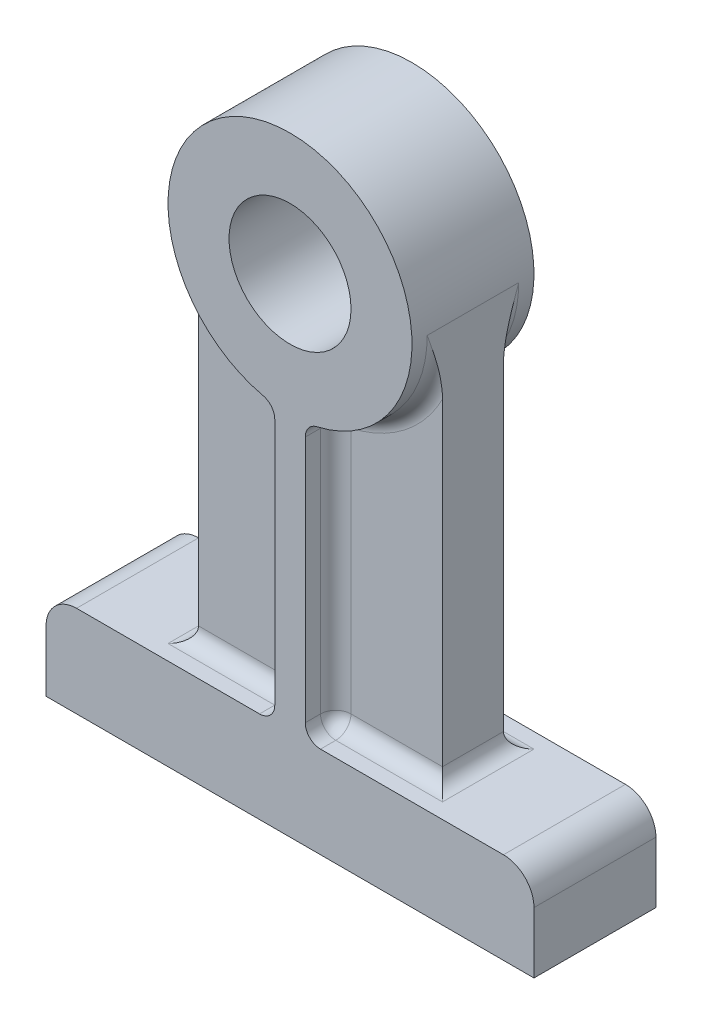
ISO-10303-21;
HEADER;
FILE_DESCRIPTION(('STEP AP214'),'2;1');
FILE_NAME('part.step','',(''),(''),'','','');
FILE_SCHEMA(('AUTOMOTIVE_DESIGN { 1 0 10303 214 1 1 1 1 }'));
ENDSEC;
DATA;
#1=APPLICATION_CONTEXT('core data for automotive mechanical design processes');
#2=APPLICATION_PROTOCOL_DEFINITION('international standard','automotive_design',2000,#1);
#3=PRODUCT_CONTEXT('',#1,'mechanical');
#4=PRODUCT('Part','Part','',(#3));
#5=PRODUCT_RELATED_PRODUCT_CATEGORY('part','',(#4));
#6=PRODUCT_DEFINITION_FORMATION('','',#4);
#7=PRODUCT_DEFINITION_CONTEXT('part definition',#1,'design');
#8=PRODUCT_DEFINITION('design','',#6,#7);
#9=PRODUCT_DEFINITION_SHAPE('','',#8);
#10=(LENGTH_UNIT() NAMED_UNIT(*) SI_UNIT(.MILLI.,.METRE.));
#11=(NAMED_UNIT(*) PLANE_ANGLE_UNIT() SI_UNIT($,.RADIAN.));
#12=(NAMED_UNIT(*) SI_UNIT($,.STERADIAN.) SOLID_ANGLE_UNIT());
#13=UNCERTAINTY_MEASURE_WITH_UNIT(LENGTH_MEASURE(1.E-05),#10,'distance_accuracy_value','');
#14=(GEOMETRIC_REPRESENTATION_CONTEXT(3) GLOBAL_UNCERTAINTY_ASSIGNED_CONTEXT((#13)) GLOBAL_UNIT_ASSIGNED_CONTEXT((#10,
#11,#12)) REPRESENTATION_CONTEXT('',''));
#15=CARTESIAN_POINT('',(0.,0.,0.));
#16=DIRECTION('',(0.,0.,1.));
#17=DIRECTION('',(1.,0.,0.));
#18=AXIS2_PLACEMENT_3D('',#15,#16,#17);
#19=CARTESIAN_POINT('',(0.,0.,3.175));
#20=DIRECTION('',(0.,0.,-1.));
#21=DIRECTION('',(-1.,0.,0.));
#22=AXIS2_PLACEMENT_3D('',#19,#20,#21);
#23=PLANE('',#22);
#24=DIRECTION('',(0.,-1.,0.));
#25=VECTOR('',#24,1.);
#26=CARTESIAN_POINT('',(3.175,0.,3.175));
#27=LINE('',#26,#25);
#28=CARTESIAN_POINT('',(3.175,-13.930255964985,3.175));
#29=VERTEX_POINT('',#28);
#30=CARTESIAN_POINT('',(3.175,-39.6875,3.175));
#31=VERTEX_POINT('',#30);
#32=EDGE_CURVE('E567',#29,#31,#27,.T.);
#33=ORIENTED_EDGE('',*,*,#32,.T.);
#34=DIRECTION('',(1.,0.,0.));
#35=VECTOR('',#34,1.);
#36=CARTESIAN_POINT('',(0.,-39.6875,3.175));
#37=LINE('',#36,#35);
#38=CARTESIAN_POINT('',(12.7,-39.6875,3.175));
#39=VERTEX_POINT('',#38);
#40=EDGE_CURVE('E521',#31,#39,#37,.T.);
#41=ORIENTED_EDGE('',*,*,#40,.T.);
#42=DIRECTION('',(0.,1.,0.));
#43=VECTOR('',#42,1.);
#44=CARTESIAN_POINT('',(12.7,0.,3.175));
#45=LINE('',#44,#43);
#46=CARTESIAN_POINT('',(12.7,-6.54543018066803,3.175));
#47=VERTEX_POINT('',#46);
#48=EDGE_CURVE('E553',#39,#47,#45,.T.);
#49=ORIENTED_EDGE('',*,*,#48,.T.);
#50=CARTESIAN_POINT('',(0.,0.,3.175));
#51=DIRECTION('',(0.,0.,-1.));
#52=DIRECTION('',(-1.,0.,0.));
#53=AXIS2_PLACEMENT_3D('',#50,#51,#52);
#54=CIRCLE('',#53,14.2875);
#55=EDGE_CURVE('E560',#47,#29,#54,.T.);
#56=ORIENTED_EDGE('',*,*,#55,.T.);
#57=EDGE_LOOP('',(#33,#41,#49,#56));
#58=FACE_BOUND('',#57,.T.);
#59=ADVANCED_FACE('F33',(#58),#23,.F.);
#60=CARTESIAN_POINT('',(25.4,-41.275,6.35));
#61=DIRECTION('',(0.,1.,0.));
#62=DIRECTION('',(0.,0.,1.));
#63=AXIS2_PLACEMENT_3D('',#60,#61,#62);
#64=PLANE('',#63);
#65=DIRECTION('',(0.,0.,-1.));
#66=VECTOR('',#65,1.);
#67=CARTESIAN_POINT('',(-3.175,-41.275,6.35));
#68=LINE('',#67,#66);
#69=CARTESIAN_POINT('',(-3.175,-41.275,6.35));
#70=VERTEX_POINT('',#69);
#71=CARTESIAN_POINT('',(-3.175,-41.275,4.7625));
#72=VERTEX_POINT('',#71);
#73=EDGE_CURVE('E592',#70,#72,#68,.T.);
#74=ORIENTED_EDGE('',*,*,#73,.T.);
#75=DIRECTION('',(1.,0.,0.));
#76=VECTOR('',#75,1.);
#77=CARTESIAN_POINT('',(25.4,-41.275,4.7625));
#78=LINE('',#77,#76);
#79=CARTESIAN_POINT('',(-14.2875,-41.275,4.7625));
#80=VERTEX_POINT('',#79);
#81=EDGE_CURVE('E527',#72,#80,#78,.F.);
#82=ORIENTED_EDGE('',*,*,#81,.T.);
#83=DIRECTION('',(0.,0.,1.));
#84=VECTOR('',#83,1.);
#85=CARTESIAN_POINT('',(-14.2875,-41.275,6.35));
#86=LINE('',#85,#84);
#87=CARTESIAN_POINT('',(-14.2875,-41.275,-4.7625));
#88=VERTEX_POINT('',#87);
#89=EDGE_CURVE('E595',#80,#88,#86,.F.);
#90=ORIENTED_EDGE('',*,*,#89,.T.);
#91=DIRECTION('',(1.,0.,0.));
#92=VECTOR('',#91,1.);
#93=CARTESIAN_POINT('',(25.4,-41.275,-4.7625));
#94=LINE('',#93,#92);
#95=CARTESIAN_POINT('',(-3.175,-41.275,-4.7625));
#96=VERTEX_POINT('',#95);
#97=EDGE_CURVE('E354',#96,#88,#94,.F.);
#98=ORIENTED_EDGE('',*,*,#97,.F.);
#99=DIRECTION('',(0.,0.,1.));
#100=VECTOR('',#99,1.);
#101=CARTESIAN_POINT('',(-3.175,-41.275,-6.35));
#102=LINE('',#101,#100);
#103=CARTESIAN_POINT('',(-3.175,-41.275,-6.35));
#104=VERTEX_POINT('',#103);
#105=EDGE_CURVE('E309',#104,#96,#102,.T.);
#106=ORIENTED_EDGE('',*,*,#105,.F.);
#107=DIRECTION('',(1.,0.,0.));
#108=VECTOR('',#107,1.);
#109=CARTESIAN_POINT('',(25.4,-41.275,-6.35));
#110=LINE('',#109,#108);
#111=CARTESIAN_POINT('',(-22.225,-41.275,-6.35));
#112=VERTEX_POINT('',#111);
#113=EDGE_CURVE('E288',#112,#104,#110,.T.);
#114=ORIENTED_EDGE('',*,*,#113,.F.);
#115=DIRECTION('',(0.,0.,-1.));
#116=VECTOR('',#115,1.);
#117=CARTESIAN_POINT('',(-22.225,-41.275,6.35));
#118=LINE('',#117,#116);
#119=CARTESIAN_POINT('',(-22.225,-41.275,6.35));
#120=VERTEX_POINT('',#119);
#121=EDGE_CURVE('E608',#112,#120,#118,.F.);
#122=ORIENTED_EDGE('',*,*,#121,.T.);
#123=DIRECTION('',(1.,0.,0.));
#124=VECTOR('',#123,1.);
#125=CARTESIAN_POINT('',(25.4,-41.275,6.35));
#126=LINE('',#125,#124);
#127=EDGE_CURVE('E266',#120,#70,#126,.T.);
#128=ORIENTED_EDGE('',*,*,#127,.T.);
#129=EDGE_LOOP('',(#74,#82,#90,#98,#106,#114,#122,#128));
#130=FACE_BOUND('',#129,.T.);
#131=ADVANCED_FACE('F453',(#130),#64,.T.);
#132=DIRECTION('',(0.,-1.,0.));
#133=VECTOR('',#132,1.);
#134=CARTESIAN_POINT('',(-12.7,-50.8,3.175));
#135=LINE('',#134,#133);
#136=CARTESIAN_POINT('',(-12.7,-6.54543018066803,3.175));
#137=VERTEX_POINT('',#136);
#138=CARTESIAN_POINT('',(-12.7,-39.6875,3.175));
#139=VERTEX_POINT('',#138);
#140=EDGE_CURVE('E563',#137,#139,#135,.T.);
#141=ORIENTED_EDGE('',*,*,#140,.T.);
#142=DIRECTION('',(1.,0.,0.));
#143=VECTOR('',#142,1.);
#144=CARTESIAN_POINT('',(0.,-39.6875,3.175));
#145=LINE('',#144,#143);
#146=CARTESIAN_POINT('',(-3.175,-39.6875,3.175));
#147=VERTEX_POINT('',#146);
#148=EDGE_CURVE('E519',#139,#147,#145,.T.);
#149=ORIENTED_EDGE('',*,*,#148,.T.);
#150=DIRECTION('',(0.,-1.,0.));
#151=VECTOR('',#150,1.);
#152=CARTESIAN_POINT('',(-3.175,-13.930255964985,3.175));
#153=LINE('',#152,#151);
#154=CARTESIAN_POINT('',(-3.175,-13.930255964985,3.175));
#155=VERTEX_POINT('',#154);
#156=EDGE_CURVE('E516',#147,#155,#153,.F.);
#157=ORIENTED_EDGE('',*,*,#156,.T.);
#158=CARTESIAN_POINT('',(0.,0.,3.175));
#159=DIRECTION('',(0.,0.,-1.));
#160=DIRECTION('',(-1.,0.,0.));
#161=AXIS2_PLACEMENT_3D('',#158,#159,#160);
#162=CIRCLE('',#161,14.2875);
#163=EDGE_CURVE('E513',#155,#137,#162,.T.);
#164=ORIENTED_EDGE('',*,*,#163,.T.);
#165=EDGE_LOOP('',(#141,#149,#157,#164));
#166=FACE_BOUND('',#165,.T.);
#167=ADVANCED_FACE('F459',(#166),#23,.F.);
#168=CARTESIAN_POINT('',(12.7,-50.8,3.175));
#169=DIRECTION('',(0.,1.,0.));
#170=DIRECTION('',(-1.,0.,0.));
#171=AXIS2_PLACEMENT_3D('',#168,#169,#170);
#172=PLANE('',#171);
#173=DIRECTION('',(-1.,0.,0.));
#174=VECTOR('',#173,1.);
#175=CARTESIAN_POINT('',(25.4,-50.8,6.35));
#176=LINE('',#175,#174);
#177=CARTESIAN_POINT('',(25.4,-50.8,6.35));
#178=VERTEX_POINT('',#177);
#179=CARTESIAN_POINT('',(-25.4,-50.8,6.35));
#180=VERTEX_POINT('',#179);
#181=EDGE_CURVE('E631',#178,#180,#176,.T.);
#182=ORIENTED_EDGE('',*,*,#181,.T.);
#183=DIRECTION('',(0.,0.,-1.));
#184=VECTOR('',#183,1.);
#185=CARTESIAN_POINT('',(-25.4,-50.8,6.35));
#186=LINE('',#185,#184);
#187=CARTESIAN_POINT('',(-25.4,-50.8,-6.35));
#188=VERTEX_POINT('',#187);
#189=EDGE_CURVE('E265',#180,#188,#186,.T.);
#190=ORIENTED_EDGE('',*,*,#189,.T.);
#191=DIRECTION('',(-1.,0.,0.));
#192=VECTOR('',#191,1.);
#193=CARTESIAN_POINT('',(25.4,-50.8,-6.35));
#194=LINE('',#193,#192);
#195=CARTESIAN_POINT('',(25.4,-50.8,-6.35));
#196=VERTEX_POINT('',#195);
#197=EDGE_CURVE('E273',#196,#188,#194,.T.);
#198=ORIENTED_EDGE('',*,*,#197,.F.);
#199=DIRECTION('',(0.,0.,-1.));
#200=VECTOR('',#199,1.);
#201=CARTESIAN_POINT('',(25.4,-50.8,6.35));
#202=LINE('',#201,#200);
#203=EDGE_CURVE('E256',#178,#196,#202,.T.);
#204=ORIENTED_EDGE('',*,*,#203,.F.);
#205=EDGE_LOOP('',(#182,#190,#198,#204));
#206=FACE_BOUND('',#205,.T.);
#207=ADVANCED_FACE('F279',(#206),#172,.F.);
#208=CARTESIAN_POINT('',(12.7,0.,3.175));
#209=DIRECTION('',(-1.,0.,0.));
#210=DIRECTION('',(0.,-1.,0.));
#211=AXIS2_PLACEMENT_3D('',#208,#209,#210);
#212=PLANE('',#211);
#213=ORIENTED_EDGE('',*,*,#48,.F.);
#214=DIRECTION('',(0.,0.,-1.));
#215=VECTOR('',#214,1.);
#216=CARTESIAN_POINT('',(12.7,-39.6875,3.175));
#217=LINE('',#216,#215);
#218=CARTESIAN_POINT('',(12.7,-39.6875,-3.175));
#219=VERTEX_POINT('',#218);
#220=EDGE_CURVE('E606',#39,#219,#217,.T.);
#221=ORIENTED_EDGE('',*,*,#220,.T.);
#222=DIRECTION('',(0.,1.,0.));
#223=VECTOR('',#222,1.);
#224=CARTESIAN_POINT('',(12.7,0.,-3.175));
#225=LINE('',#224,#223);
#226=CARTESIAN_POINT('',(12.7,-6.54543018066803,-3.175));
#227=VERTEX_POINT('',#226);
#228=EDGE_CURVE('E291',#219,#227,#225,.T.);
#229=ORIENTED_EDGE('',*,*,#228,.T.);
#230=CARTESIAN_POINT('',(12.7,-6.54543018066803,-3.175));
#231=CARTESIAN_POINT('',(12.7,-6.41036420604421,-3.17502855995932));
#232=CARTESIAN_POINT('',(12.7,-6.27534290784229,-3.17861604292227));
#233=CARTESIAN_POINT('',(12.7,-6.00568324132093,-3.1920675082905));
#234=CARTESIAN_POINT('',(12.7,-5.87104469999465,-3.20192795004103));
#235=CARTESIAN_POINT('',(12.7,-5.60262119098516,-3.22705502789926));
#236=CARTESIAN_POINT('',(12.7,-5.46883493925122,-3.24230833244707));
#237=CARTESIAN_POINT('',(12.7,-5.20187617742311,-3.27756229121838));
#238=CARTESIAN_POINT('',(12.7,-5.06870376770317,-3.29756369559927));
#239=CARTESIAN_POINT('',(12.7,-4.67227650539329,-3.36345058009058));
#240=CARTESIAN_POINT('',(12.7,-4.41002980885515,-3.41543294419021));
#241=CARTESIAN_POINT('',(12.7,-3.88823303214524,-3.53197981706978));
#242=CARTESIAN_POINT('',(12.7,-3.6286850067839,-3.59655326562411));
#243=CARTESIAN_POINT('',(12.7,-3.0870810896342,-3.74197317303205));
#244=CARTESIAN_POINT('',(12.7,-2.80528872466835,-3.82379117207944));
#245=CARTESIAN_POINT('',(12.7,-2.24428413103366,-3.99553860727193));
#246=CARTESIAN_POINT('',(12.7,-1.96507139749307,-4.08546641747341));
#247=CARTESIAN_POINT('',(12.7,-1.12919924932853,-4.36334757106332));
#248=CARTESIAN_POINT('',(12.7,-0.575182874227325,-4.55914314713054));
#249=CARTESIAN_POINT('',(12.7,-0.0141665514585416,-4.7574913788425));
#250=CARTESIAN_POINT('',(12.7,-0.00708327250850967,-4.75999569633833));
#251=CARTESIAN_POINT('',(12.7,0.,-4.7625));
#252=B_SPLINE_CURVE_WITH_KNOTS('',3,(#230,#231,#232,#233,#234,#235,#236,#237,#238,#239,#240,
#241,#242,#243,#244,#245,#246,#247,#248,#249,#250,#251),.UNSPECIFIED.,.F.,.F.,(4,2,2,2,2,2,2,2,
2,2,4),(0.,0.405087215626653,0.809945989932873,1.21381084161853,1.61773954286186,
2.41933073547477,3.22149315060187,4.10160058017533,4.98153194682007,6.74413264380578,
6.76667149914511),.UNSPECIFIED.);
#253=CARTESIAN_POINT('',(12.7,0.,-4.7625));
#254=VERTEX_POINT('',#253);
#255=EDGE_CURVE('E387',#254,#227,#252,.F.);
#256=ORIENTED_EDGE('',*,*,#255,.F.);
#257=DIRECTION('',(0.,0.,-1.));
#258=VECTOR('',#257,1.);
#259=CARTESIAN_POINT('',(12.7,0.,3.175));
#260=LINE('',#259,#258);
#261=CARTESIAN_POINT('',(12.7,0.,4.7625));
#262=VERTEX_POINT('',#261);
#263=EDGE_CURVE('E51',#262,#254,#260,.T.);
#264=ORIENTED_EDGE('',*,*,#263,.F.);
#265=CARTESIAN_POINT('',(12.7,-6.54543018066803,3.175));
#266=CARTESIAN_POINT('',(12.7,-6.41036420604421,3.17502855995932));
#267=CARTESIAN_POINT('',(12.7,-6.27534290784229,3.17861604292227));
#268=CARTESIAN_POINT('',(12.7,-6.00568324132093,3.1920675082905));
#269=CARTESIAN_POINT('',(12.7,-5.87104469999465,3.20192795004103));
#270=CARTESIAN_POINT('',(12.7,-5.60262119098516,3.22705502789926));
#271=CARTESIAN_POINT('',(12.7,-5.46883493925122,3.24230833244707));
#272=CARTESIAN_POINT('',(12.7,-5.20187617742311,3.27756229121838));
#273=CARTESIAN_POINT('',(12.7,-5.06870376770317,3.29756369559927));
#274=CARTESIAN_POINT('',(12.7,-4.67227650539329,3.36345058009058));
#275=CARTESIAN_POINT('',(12.7,-4.41002980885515,3.41543294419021));
#276=CARTESIAN_POINT('',(12.7,-3.88823303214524,3.53197981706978));
#277=CARTESIAN_POINT('',(12.7,-3.6286850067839,3.59655326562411));
#278=CARTESIAN_POINT('',(12.7,-3.0870810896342,3.74197317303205));
#279=CARTESIAN_POINT('',(12.7,-2.80528872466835,3.82379117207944));
#280=CARTESIAN_POINT('',(12.7,-2.24428413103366,3.99553860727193));
#281=CARTESIAN_POINT('',(12.7,-1.96507139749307,4.08546641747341));
#282=CARTESIAN_POINT('',(12.7,-1.12919924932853,4.36334757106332));
#283=CARTESIAN_POINT('',(12.7,-0.575182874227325,4.55914314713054));
#284=CARTESIAN_POINT('',(12.7,-0.0141665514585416,4.7574913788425));
#285=CARTESIAN_POINT('',(12.7,-0.00708327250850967,4.75999569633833));
#286=CARTESIAN_POINT('',(12.7,0.,4.7625));
#287=B_SPLINE_CURVE_WITH_KNOTS('',3,(#265,#266,#267,#268,#269,#270,#271,#272,#273,#274,#275,
#276,#277,#278,#279,#280,#281,#282,#283,#284,#285,#286),.UNSPECIFIED.,.F.,.F.,(4,2,2,2,2,2,2,2,
2,2,4),(0.,0.405087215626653,0.809945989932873,1.21381084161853,1.61773954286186,
2.41933073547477,3.22149315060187,4.10160058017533,4.98153194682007,6.74413264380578,
6.76667149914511),.UNSPECIFIED.);
#288=EDGE_CURVE('E43',#262,#47,#287,.F.);
#289=ORIENTED_EDGE('',*,*,#288,.T.);
#290=EDGE_LOOP('',(#213,#221,#229,#256,#264,#289));
#291=FACE_BOUND('',#290,.T.);
#292=ADVANCED_FACE('F552',(#291),#212,.F.);
#293=CARTESIAN_POINT('',(0.,0.,3.175));
#294=DIRECTION('',(0.,0.,-1.));
#295=DIRECTION('',(-1.,0.,0.));
#296=AXIS2_PLACEMENT_3D('',#293,#294,#295);
#297=CYLINDRICAL_SURFACE('',#296,12.7);
#298=DIRECTION('',(0.,0.,-1.));
#299=VECTOR('',#298,1.);
#300=CARTESIAN_POINT('',(2.82222222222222,-12.3824497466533,3.175));
#301=LINE('',#300,#299);
#302=CARTESIAN_POINT('',(2.82222222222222,-12.3824497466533,6.35));
#303=VERTEX_POINT('',#302);
#304=CARTESIAN_POINT('',(2.82222222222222,-12.3824497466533,4.7625));
#305=VERTEX_POINT('',#304);
#306=EDGE_CURVE('E579',#303,#305,#301,.T.);
#307=ORIENTED_EDGE('',*,*,#306,.T.);
#308=CARTESIAN_POINT('',(0.,0.,4.7625));
#309=DIRECTION('',(0.,0.,-1.));
#310=DIRECTION('',(-1.,0.,0.));
#311=AXIS2_PLACEMENT_3D('',#308,#309,#310);
#312=CIRCLE('',#311,12.7);
#313=EDGE_CURVE('E542',#305,#262,#312,.F.);
#314=ORIENTED_EDGE('',*,*,#313,.T.);
#315=ORIENTED_EDGE('',*,*,#263,.T.);
#316=CARTESIAN_POINT('',(0.,0.,-4.7625));
#317=DIRECTION('',(0.,0.,-1.));
#318=DIRECTION('',(-1.,0.,0.));
#319=AXIS2_PLACEMENT_3D('',#316,#317,#318);
#320=CIRCLE('',#319,12.7);
#321=CARTESIAN_POINT('',(2.82222222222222,-12.3824497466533,-4.7625));
#322=VERTEX_POINT('',#321);
#323=EDGE_CURVE('E378',#322,#254,#320,.F.);
#324=ORIENTED_EDGE('',*,*,#323,.F.);
#325=DIRECTION('',(0.,0.,1.));
#326=VECTOR('',#325,1.);
#327=CARTESIAN_POINT('',(2.82222222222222,-12.3824497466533,-3.175));
#328=LINE('',#327,#326);
#329=CARTESIAN_POINT('',(2.82222222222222,-12.3824497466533,-6.35));
#330=VERTEX_POINT('',#329);
#331=EDGE_CURVE('E320',#330,#322,#328,.T.);
#332=ORIENTED_EDGE('',*,*,#331,.F.);
#333=CARTESIAN_POINT('',(0.,0.,-6.35));
#334=DIRECTION('',(0.,0.,1.));
#335=DIRECTION('',(1.,0.,0.));
#336=AXIS2_PLACEMENT_3D('',#333,#334,#335);
#337=CIRCLE('',#336,12.7);
#338=CARTESIAN_POINT('',(-2.82222222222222,-12.3824497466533,-6.35));
#339=VERTEX_POINT('',#338);
#340=EDGE_CURVE('E277',#330,#339,#337,.T.);
#341=ORIENTED_EDGE('',*,*,#340,.T.);
#342=DIRECTION('',(0.,0.,1.));
#343=VECTOR('',#342,1.);
#344=CARTESIAN_POINT('',(-2.82222222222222,-12.3824497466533,-3.175));
#345=LINE('',#344,#343);
#346=CARTESIAN_POINT('',(-2.82222222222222,-12.3824497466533,-4.7625));
#347=VERTEX_POINT('',#346);
#348=EDGE_CURVE('E317',#347,#339,#345,.F.);
#349=ORIENTED_EDGE('',*,*,#348,.F.);
#350=CARTESIAN_POINT('',(0.,0.,-4.7625));
#351=DIRECTION('',(0.,0.,-1.));
#352=DIRECTION('',(-1.,0.,0.));
#353=AXIS2_PLACEMENT_3D('',#350,#351,#352);
#354=CIRCLE('',#353,12.7);
#355=CARTESIAN_POINT('',(-12.7,0.,-4.7625));
#356=VERTEX_POINT('',#355);
#357=EDGE_CURVE('E375',#356,#347,#354,.F.);
#358=ORIENTED_EDGE('',*,*,#357,.F.);
#359=DIRECTION('',(0.,0.,-1.));
#360=VECTOR('',#359,1.);
#361=CARTESIAN_POINT('',(-12.7,0.,3.175));
#362=LINE('',#361,#360);
#363=CARTESIAN_POINT('',(-12.7,0.,4.7625));
#364=VERTEX_POINT('',#363);
#365=EDGE_CURVE('E59',#364,#356,#362,.T.);
#366=ORIENTED_EDGE('',*,*,#365,.F.);
#367=CARTESIAN_POINT('',(0.,0.,4.7625));
#368=DIRECTION('',(0.,0.,-1.));
#369=DIRECTION('',(-1.,0.,0.));
#370=AXIS2_PLACEMENT_3D('',#367,#368,#369);
#371=CIRCLE('',#370,12.7);
#372=CARTESIAN_POINT('',(-2.82222222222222,-12.3824497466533,4.7625));
#373=VERTEX_POINT('',#372);
#374=EDGE_CURVE('E512',#364,#373,#371,.F.);
#375=ORIENTED_EDGE('',*,*,#374,.T.);
#376=DIRECTION('',(0.,0.,-1.));
#377=VECTOR('',#376,1.);
#378=CARTESIAN_POINT('',(-2.82222222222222,-12.3824497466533,3.175));
#379=LINE('',#378,#377);
#380=CARTESIAN_POINT('',(-2.82222222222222,-12.3824497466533,6.35));
#381=VERTEX_POINT('',#380);
#382=EDGE_CURVE('E582',#373,#381,#379,.F.);
#383=ORIENTED_EDGE('',*,*,#382,.T.);
#384=CARTESIAN_POINT('',(0.,0.,6.35));
#385=DIRECTION('',(0.,0.,1.));
#386=DIRECTION('',(1.,0.,0.));
#387=AXIS2_PLACEMENT_3D('',#384,#385,#386);
#388=CIRCLE('',#387,12.7);
#389=EDGE_CURVE('E634',#303,#381,#388,.T.);
#390=ORIENTED_EDGE('',*,*,#389,.F.);
#391=EDGE_LOOP('',(#307,#314,#315,#324,#332,#341,#349,#358,#366,#375,#383,#390));
#392=FACE_BOUND('',#391,.T.);
#393=ADVANCED_FACE('F466',(#392),#297,.T.);
#394=CARTESIAN_POINT('',(-12.7,-50.8,3.175));
#395=DIRECTION('',(1.,0.,0.));
#396=DIRECTION('',(0.,1.,0.));
#397=AXIS2_PLACEMENT_3D('',#394,#395,#396);
#398=PLANE('',#397);
#399=ORIENTED_EDGE('',*,*,#365,.T.);
#400=CARTESIAN_POINT('',(-12.7,-6.54543018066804,-3.175));
#401=CARTESIAN_POINT('',(-12.7,-6.41036420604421,-3.17502855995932));
#402=CARTESIAN_POINT('',(-12.7,-6.27534290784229,-3.17861604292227));
#403=CARTESIAN_POINT('',(-12.7,-6.00568324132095,-3.1920675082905));
#404=CARTESIAN_POINT('',(-12.7,-5.87104469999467,-3.20192795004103));
#405=CARTESIAN_POINT('',(-12.7,-5.60262119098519,-3.22705502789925));
#406=CARTESIAN_POINT('',(-12.7,-5.46883493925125,-3.24230833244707));
#407=CARTESIAN_POINT('',(-12.7,-5.20187617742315,-3.27756229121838));
#408=CARTESIAN_POINT('',(-12.7,-5.06870376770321,-3.29756369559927));
#409=CARTESIAN_POINT('',(-12.7,-4.67227650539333,-3.36345058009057));
#410=CARTESIAN_POINT('',(-12.7,-4.41002980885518,-3.4154329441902));
#411=CARTESIAN_POINT('',(-12.7,-3.88823303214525,-3.53197981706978));
#412=CARTESIAN_POINT('',(-12.7,-3.62868500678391,-3.59655326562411));
#413=CARTESIAN_POINT('',(-12.7,-3.0870810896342,-3.74197317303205));
#414=CARTESIAN_POINT('',(-12.7,-2.80528872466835,-3.82379117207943));
#415=CARTESIAN_POINT('',(-12.7,-2.24428413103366,-3.99553860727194));
#416=CARTESIAN_POINT('',(-12.7,-1.96507139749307,-4.08546641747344));
#417=CARTESIAN_POINT('',(-12.7,-1.12919924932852,-4.36334757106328));
#418=CARTESIAN_POINT('',(-12.7,-0.575182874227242,-4.55914314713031));
#419=CARTESIAN_POINT('',(-12.7,-0.0141665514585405,-4.7574913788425));
#420=CARTESIAN_POINT('',(-12.7,-0.00708327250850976,-4.75999569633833));
#421=CARTESIAN_POINT('',(-12.7,0.,-4.7625));
#422=B_SPLINE_CURVE_WITH_KNOTS('',3,(#400,#401,#402,#403,#404,#405,#406,#407,#408,#409,#410,
#411,#412,#413,#414,#415,#416,#417,#418,#419,#420,#421),.UNSPECIFIED.,.F.,.F.,(4,2,2,2,2,2,2,2,
2,2,4),(0.,0.40508721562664,0.809945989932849,1.2138108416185,1.61773954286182,2.41933073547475,
3.22149315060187,4.10160058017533,4.98153194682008,6.74413264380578,6.76667149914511),.UNSPECIFIED.);
#423=CARTESIAN_POINT('',(-12.7,-6.54543018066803,-3.175));
#424=VERTEX_POINT('',#423);
#425=EDGE_CURVE('E394',#424,#356,#422,.T.);
#426=ORIENTED_EDGE('',*,*,#425,.F.);
#427=DIRECTION('',(0.,-1.,0.));
#428=VECTOR('',#427,1.);
#429=CARTESIAN_POINT('',(-12.7,-50.8,-3.175));
#430=LINE('',#429,#428);
#431=CARTESIAN_POINT('',(-12.7,-39.6875,-3.175));
#432=VERTEX_POINT('',#431);
#433=EDGE_CURVE('E294',#424,#432,#430,.T.);
#434=ORIENTED_EDGE('',*,*,#433,.T.);
#435=DIRECTION('',(0.,0.,1.));
#436=VECTOR('',#435,1.);
#437=CARTESIAN_POINT('',(-12.7,-39.6875,3.175));
#438=LINE('',#437,#436);
#439=EDGE_CURVE('E584',#432,#139,#438,.T.);
#440=ORIENTED_EDGE('',*,*,#439,.T.);
#441=ORIENTED_EDGE('',*,*,#140,.F.);
#442=CARTESIAN_POINT('',(-12.7,-6.54543018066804,3.175));
#443=CARTESIAN_POINT('',(-12.7,-6.41036420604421,3.17502855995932));
#444=CARTESIAN_POINT('',(-12.7,-6.27534290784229,3.17861604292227));
#445=CARTESIAN_POINT('',(-12.7,-6.00568324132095,3.1920675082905));
#446=CARTESIAN_POINT('',(-12.7,-5.87104469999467,3.20192795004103));
#447=CARTESIAN_POINT('',(-12.7,-5.60262119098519,3.22705502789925));
#448=CARTESIAN_POINT('',(-12.7,-5.46883493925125,3.24230833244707));
#449=CARTESIAN_POINT('',(-12.7,-5.20187617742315,3.27756229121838));
#450=CARTESIAN_POINT('',(-12.7,-5.06870376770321,3.29756369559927));
#451=CARTESIAN_POINT('',(-12.7,-4.67227650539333,3.36345058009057));
#452=CARTESIAN_POINT('',(-12.7,-4.41002980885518,3.4154329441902));
#453=CARTESIAN_POINT('',(-12.7,-3.88823303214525,3.53197981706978));
#454=CARTESIAN_POINT('',(-12.7,-3.62868500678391,3.59655326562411));
#455=CARTESIAN_POINT('',(-12.7,-3.0870810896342,3.74197317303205));
#456=CARTESIAN_POINT('',(-12.7,-2.80528872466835,3.82379117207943));
#457=CARTESIAN_POINT('',(-12.7,-2.24428413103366,3.99553860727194));
#458=CARTESIAN_POINT('',(-12.7,-1.96507139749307,4.08546641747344));
#459=CARTESIAN_POINT('',(-12.7,-1.12919924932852,4.36334757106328));
#460=CARTESIAN_POINT('',(-12.7,-0.575182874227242,4.55914314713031));
#461=CARTESIAN_POINT('',(-12.7,-0.0141665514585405,4.7574913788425));
#462=CARTESIAN_POINT('',(-12.7,-0.00708327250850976,4.75999569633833));
#463=CARTESIAN_POINT('',(-12.7,0.,4.7625));
#464=B_SPLINE_CURVE_WITH_KNOTS('',3,(#442,#443,#444,#445,#446,#447,#448,#449,#450,#451,#452,
#453,#454,#455,#456,#457,#458,#459,#460,#461,#462,#463),.UNSPECIFIED.,.F.,.F.,(4,2,2,2,2,2,2,2,
2,2,4),(0.,0.40508721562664,0.809945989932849,1.2138108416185,1.61773954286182,2.41933073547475,
3.22149315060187,4.10160058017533,4.98153194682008,6.74413264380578,6.76667149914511),.UNSPECIFIED.);
#465=EDGE_CURVE('E11',#137,#364,#464,.T.);
#466=ORIENTED_EDGE('',*,*,#465,.T.);
#467=EDGE_LOOP('',(#399,#426,#434,#440,#441,#466));
#468=FACE_BOUND('',#467,.T.);
#469=ADVANCED_FACE('F451',(#468),#398,.F.);
#470=DIRECTION('',(0.,0.,-1.));
#471=VECTOR('',#470,1.);
#472=CARTESIAN_POINT('',(14.2875,-41.275,6.35));
#473=LINE('',#472,#471);
#474=CARTESIAN_POINT('',(14.2875,-41.275,-4.7625));
#475=VERTEX_POINT('',#474);
#476=CARTESIAN_POINT('',(14.2875,-41.275,4.7625));
#477=VERTEX_POINT('',#476);
#478=EDGE_CURVE('E602',#475,#477,#473,.F.);
#479=ORIENTED_EDGE('',*,*,#478,.T.);
#480=DIRECTION('',(1.,0.,0.));
#481=VECTOR('',#480,1.);
#482=CARTESIAN_POINT('',(25.4,-41.275,4.7625));
#483=LINE('',#482,#481);
#484=CARTESIAN_POINT('',(3.175,-41.275,4.7625));
#485=VERTEX_POINT('',#484);
#486=EDGE_CURVE('E517',#477,#485,#483,.F.);
#487=ORIENTED_EDGE('',*,*,#486,.T.);
#488=DIRECTION('',(0.,0.,-1.));
#489=VECTOR('',#488,1.);
#490=CARTESIAN_POINT('',(3.175,-41.275,6.35));
#491=LINE('',#490,#489);
#492=CARTESIAN_POINT('',(3.175,-41.275,6.35));
#493=VERTEX_POINT('',#492);
#494=EDGE_CURVE('E604',#485,#493,#491,.F.);
#495=ORIENTED_EDGE('',*,*,#494,.T.);
#496=CARTESIAN_POINT('',(22.225,-41.275,6.35));
#497=VERTEX_POINT('',#496);
#498=EDGE_CURVE('E627',#493,#497,#126,.T.);
#499=ORIENTED_EDGE('',*,*,#498,.T.);
#500=DIRECTION('',(0.,0.,-1.));
#501=VECTOR('',#500,1.);
#502=CARTESIAN_POINT('',(22.225,-41.275,6.35));
#503=LINE('',#502,#501);
#504=CARTESIAN_POINT('',(22.225,-41.275,-6.35));
#505=VERTEX_POINT('',#504);
#506=EDGE_CURVE('E619',#497,#505,#503,.T.);
#507=ORIENTED_EDGE('',*,*,#506,.T.);
#508=CARTESIAN_POINT('',(3.175,-41.275,-6.35));
#509=VERTEX_POINT('',#508);
#510=EDGE_CURVE('E284',#509,#505,#110,.T.);
#511=ORIENTED_EDGE('',*,*,#510,.F.);
#512=DIRECTION('',(0.,0.,1.));
#513=VECTOR('',#512,1.);
#514=CARTESIAN_POINT('',(3.175,-41.275,-6.35));
#515=LINE('',#514,#513);
#516=CARTESIAN_POINT('',(3.175,-41.275,-4.7625));
#517=VERTEX_POINT('',#516);
#518=EDGE_CURVE('E301',#517,#509,#515,.F.);
#519=ORIENTED_EDGE('',*,*,#518,.F.);
#520=DIRECTION('',(1.,0.,0.));
#521=VECTOR('',#520,1.);
#522=CARTESIAN_POINT('',(25.4,-41.275,-4.7625));
#523=LINE('',#522,#521);
#524=EDGE_CURVE('E342',#475,#517,#523,.F.);
#525=ORIENTED_EDGE('',*,*,#524,.F.);
#526=EDGE_LOOP('',(#479,#487,#495,#499,#507,#511,#519,#525));
#527=FACE_BOUND('',#526,.T.);
#528=ADVANCED_FACE('F448',(#527),#64,.T.);
#529=CARTESIAN_POINT('',(25.4,-41.275,6.35));
#530=DIRECTION('',(1.,0.,0.));
#531=DIRECTION('',(0.,1.,0.));
#532=AXIS2_PLACEMENT_3D('',#529,#530,#531);
#533=PLANE('',#532);
#534=ORIENTED_EDGE('',*,*,#203,.T.);
#535=DIRECTION('',(0.,-1.,0.));
#536=VECTOR('',#535,1.);
#537=CARTESIAN_POINT('',(25.4,-41.275,-6.35));
#538=LINE('',#537,#536);
#539=CARTESIAN_POINT('',(25.4,-44.45,-6.35));
#540=VERTEX_POINT('',#539);
#541=EDGE_CURVE('E259',#540,#196,#538,.T.);
#542=ORIENTED_EDGE('',*,*,#541,.F.);
#543=DIRECTION('',(0.,0.,-1.));
#544=VECTOR('',#543,1.);
#545=CARTESIAN_POINT('',(25.4,-44.45,6.35));
#546=LINE('',#545,#544);
#547=CARTESIAN_POINT('',(25.4,-44.45,6.35));
#548=VERTEX_POINT('',#547);
#549=EDGE_CURVE('E617',#540,#548,#546,.F.);
#550=ORIENTED_EDGE('',*,*,#549,.T.);
#551=DIRECTION('',(0.,-1.,0.));
#552=VECTOR('',#551,1.);
#553=CARTESIAN_POINT('',(25.4,-41.275,6.35));
#554=LINE('',#553,#552);
#555=EDGE_CURVE('E261',#548,#178,#554,.T.);
#556=ORIENTED_EDGE('',*,*,#555,.T.);
#557=EDGE_LOOP('',(#534,#542,#550,#556));
#558=FACE_BOUND('',#557,.T.);
#559=ADVANCED_FACE('F258',(#558),#533,.T.);
#560=CARTESIAN_POINT('',(-25.4,-41.275,6.35));
#561=DIRECTION('',(-1.,0.,0.));
#562=DIRECTION('',(0.,-1.,0.));
#563=AXIS2_PLACEMENT_3D('',#560,#561,#562);
#564=PLANE('',#563);
#565=DIRECTION('',(0.,1.,0.));
#566=VECTOR('',#565,1.);
#567=CARTESIAN_POINT('',(-25.4,-41.275,6.35));
#568=LINE('',#567,#566);
#569=CARTESIAN_POINT('',(-25.4,-44.45,6.35));
#570=VERTEX_POINT('',#569);
#571=EDGE_CURVE('E628',#180,#570,#568,.T.);
#572=ORIENTED_EDGE('',*,*,#571,.T.);
#573=DIRECTION('',(0.,0.,-1.));
#574=VECTOR('',#573,1.);
#575=CARTESIAN_POINT('',(-25.4,-44.45,6.35));
#576=LINE('',#575,#574);
#577=CARTESIAN_POINT('',(-25.4,-44.45,-6.35));
#578=VERTEX_POINT('',#577);
#579=EDGE_CURVE('E610',#570,#578,#576,.T.);
#580=ORIENTED_EDGE('',*,*,#579,.T.);
#581=DIRECTION('',(0.,1.,0.));
#582=VECTOR('',#581,1.);
#583=CARTESIAN_POINT('',(-25.4,-41.275,-6.35));
#584=LINE('',#583,#582);
#585=EDGE_CURVE('E282',#188,#578,#584,.T.);
#586=ORIENTED_EDGE('',*,*,#585,.F.);
#587=ORIENTED_EDGE('',*,*,#189,.F.);
#588=EDGE_LOOP('',(#572,#580,#586,#587));
#589=FACE_BOUND('',#588,.T.);
#590=ADVANCED_FACE('F446',(#589),#564,.T.);
#591=CARTESIAN_POINT('',(25.4,-50.8,6.35));
#592=DIRECTION('',(0.,0.,-1.));
#593=DIRECTION('',(-1.,0.,0.));
#594=AXIS2_PLACEMENT_3D('',#591,#592,#593);
#595=PLANE('',#594);
#596=CARTESIAN_POINT('',(0.,0.,6.35));
#597=DIRECTION('',(0.,0.,1.));
#598=DIRECTION('',(1.,0.,0.));
#599=AXIS2_PLACEMENT_3D('',#596,#597,#598);
#600=CIRCLE('',#599,6.35);
#601=CARTESIAN_POINT('',(6.35,0.,6.35));
#602=VERTEX_POINT('',#601);
#603=EDGE_CURVE('E686',#602,#602,#600,.T.);
#604=ORIENTED_EDGE('',*,*,#603,.F.);
#605=EDGE_LOOP('',(#604));
#606=FACE_BOUND('',#605,.T.);
#607=ORIENTED_EDGE('',*,*,#555,.F.);
#608=CARTESIAN_POINT('',(22.225,-44.45,6.35));
#609=DIRECTION('',(0.,0.,-1.));
#610=DIRECTION('',(-1.,0.,0.));
#611=AXIS2_PLACEMENT_3D('',#608,#609,#610);
#612=CIRCLE('',#611,3.175);
#613=EDGE_CURVE('E612',#548,#497,#612,.F.);
#614=ORIENTED_EDGE('',*,*,#613,.T.);
#615=ORIENTED_EDGE('',*,*,#498,.F.);
#616=CARTESIAN_POINT('',(3.175,-39.6875,6.35));
#617=DIRECTION('',(0.,0.,-1.));
#618=DIRECTION('',(-1.,0.,0.));
#619=AXIS2_PLACEMENT_3D('',#616,#617,#618);
#620=CIRCLE('',#619,1.5875);
#621=CARTESIAN_POINT('',(1.5875,-39.6875,6.35));
#622=VERTEX_POINT('',#621);
#623=EDGE_CURVE('E577',#493,#622,#620,.T.);
#624=ORIENTED_EDGE('',*,*,#623,.T.);
#625=DIRECTION('',(0.,-1.,0.));
#626=VECTOR('',#625,1.);
#627=CARTESIAN_POINT('',(1.5875,-12.7,6.35));
#628=LINE('',#627,#626);
#629=CARTESIAN_POINT('',(1.5875,-13.930255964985,6.35));
#630=VERTEX_POINT('',#629);
#631=EDGE_CURVE('E637',#622,#630,#628,.F.);
#632=ORIENTED_EDGE('',*,*,#631,.T.);
#633=CARTESIAN_POINT('',(3.175,-13.930255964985,6.35));
#634=DIRECTION('',(0.,0.,-1.));
#635=DIRECTION('',(-1.,0.,0.));
#636=AXIS2_PLACEMENT_3D('',#633,#634,#635);
#637=CIRCLE('',#636,1.5875);
#638=EDGE_CURVE('E571',#630,#303,#637,.T.);
#639=ORIENTED_EDGE('',*,*,#638,.T.);
#640=ORIENTED_EDGE('',*,*,#389,.T.);
#641=CARTESIAN_POINT('',(-3.175,-13.930255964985,6.35));
#642=DIRECTION('',(0.,0.,-1.));
#643=DIRECTION('',(-1.,0.,0.));
#644=AXIS2_PLACEMENT_3D('',#641,#642,#643);
#645=CIRCLE('',#644,1.5875);
#646=CARTESIAN_POINT('',(-1.5875,-13.930255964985,6.35));
#647=VERTEX_POINT('',#646);
#648=EDGE_CURVE('E568',#381,#647,#645,.T.);
#649=ORIENTED_EDGE('',*,*,#648,.T.);
#650=DIRECTION('',(0.,1.,0.));
#651=VECTOR('',#650,1.);
#652=CARTESIAN_POINT('',(-1.5875,-12.7,6.35));
#653=LINE('',#652,#651);
#654=CARTESIAN_POINT('',(-1.5875,-39.6875,6.35));
#655=VERTEX_POINT('',#654);
#656=EDGE_CURVE('E491',#647,#655,#653,.F.);
#657=ORIENTED_EDGE('',*,*,#656,.T.);
#658=CARTESIAN_POINT('',(-3.175,-39.6875,6.35));
#659=DIRECTION('',(0.,0.,-1.));
#660=DIRECTION('',(-1.,0.,0.));
#661=AXIS2_PLACEMENT_3D('',#658,#659,#660);
#662=CIRCLE('',#661,1.5875);
#663=EDGE_CURVE('E575',#655,#70,#662,.T.);
#664=ORIENTED_EDGE('',*,*,#663,.T.);
#665=ORIENTED_EDGE('',*,*,#127,.F.);
#666=CARTESIAN_POINT('',(-22.225,-44.45,6.35));
#667=DIRECTION('',(0.,0.,-1.));
#668=DIRECTION('',(-1.,0.,0.));
#669=AXIS2_PLACEMENT_3D('',#666,#667,#668);
#670=CIRCLE('',#669,3.175);
#671=EDGE_CURVE('E615',#120,#570,#670,.F.);
#672=ORIENTED_EDGE('',*,*,#671,.T.);
#673=ORIENTED_EDGE('',*,*,#571,.F.);
#674=ORIENTED_EDGE('',*,*,#181,.F.);
#675=EDGE_LOOP('',(#607,#614,#615,#624,#632,#639,#640,#649,#657,#664,#665,#672,#673,#674));
#676=FACE_BOUND('',#675,.T.);
#677=ADVANCED_FACE('F438',(#606,#676),#595,.F.);
#678=CARTESIAN_POINT('',(1.5875,-12.7,6.35));
#679=DIRECTION('',(1.,0.,0.));
#680=DIRECTION('',(0.,1.,0.));
#681=AXIS2_PLACEMENT_3D('',#678,#679,#680);
#682=PLANE('',#681);
#683=DIRECTION('',(0.,0.,-1.));
#684=VECTOR('',#683,1.);
#685=CARTESIAN_POINT('',(1.5875,-39.6875,3.175));
#686=LINE('',#685,#684);
#687=CARTESIAN_POINT('',(1.5875,-39.6875,4.7625));
#688=VERTEX_POINT('',#687);
#689=EDGE_CURVE('E597',#622,#688,#686,.T.);
#690=ORIENTED_EDGE('',*,*,#689,.T.);
#691=DIRECTION('',(0.,-1.,0.));
#692=VECTOR('',#691,1.);
#693=CARTESIAN_POINT('',(1.5875,-12.7,4.7625));
#694=LINE('',#693,#692);
#695=CARTESIAN_POINT('',(1.5875,-13.930255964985,4.7625));
#696=VERTEX_POINT('',#695);
#697=EDGE_CURVE('E534',#688,#696,#694,.F.);
#698=ORIENTED_EDGE('',*,*,#697,.T.);
#699=DIRECTION('',(0.,0.,-1.));
#700=VECTOR('',#699,1.);
#701=CARTESIAN_POINT('',(1.5875,-13.930255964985,6.35));
#702=LINE('',#701,#700);
#703=EDGE_CURVE('E600',#696,#630,#702,.F.);
#704=ORIENTED_EDGE('',*,*,#703,.T.);
#705=ORIENTED_EDGE('',*,*,#631,.F.);
#706=EDGE_LOOP('',(#690,#698,#704,#705));
#707=FACE_BOUND('',#706,.T.);
#708=ADVANCED_FACE('F434',(#707),#682,.T.);
#709=CARTESIAN_POINT('',(-1.5875,-12.7,6.35));
#710=DIRECTION('',(1.,0.,0.));
#711=DIRECTION('',(0.,1.,0.));
#712=AXIS2_PLACEMENT_3D('',#709,#710,#711);
#713=PLANE('',#712);
#714=DIRECTION('',(0.,0.,1.));
#715=VECTOR('',#714,1.);
#716=CARTESIAN_POINT('',(-1.5875,-13.930255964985,3.175));
#717=LINE('',#716,#715);
#718=CARTESIAN_POINT('',(-1.5875,-13.930255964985,4.7625));
#719=VERTEX_POINT('',#718);
#720=EDGE_CURVE('E589',#647,#719,#717,.F.);
#721=ORIENTED_EDGE('',*,*,#720,.T.);
#722=DIRECTION('',(0.,-1.,0.));
#723=VECTOR('',#722,1.);
#724=CARTESIAN_POINT('',(-1.5875,-39.6875,4.7625));
#725=LINE('',#724,#723);
#726=CARTESIAN_POINT('',(-1.5875,-39.6875,4.7625));
#727=VERTEX_POINT('',#726);
#728=EDGE_CURVE('E536',#719,#727,#725,.T.);
#729=ORIENTED_EDGE('',*,*,#728,.T.);
#730=DIRECTION('',(0.,0.,-1.));
#731=VECTOR('',#730,1.);
#732=CARTESIAN_POINT('',(-1.5875,-39.6875,6.35));
#733=LINE('',#732,#731);
#734=EDGE_CURVE('E587',#727,#655,#733,.F.);
#735=ORIENTED_EDGE('',*,*,#734,.T.);
#736=ORIENTED_EDGE('',*,*,#656,.F.);
#737=EDGE_LOOP('',(#721,#729,#735,#736));
#738=FACE_BOUND('',#737,.T.);
#739=ADVANCED_FACE('F437',(#738),#713,.F.);
#740=CARTESIAN_POINT('',(22.225,-44.45,6.35));
#741=DIRECTION('',(0.,0.,-1.));
#742=DIRECTION('',(-1.,0.,0.));
#743=AXIS2_PLACEMENT_3D('',#740,#741,#742);
#744=CYLINDRICAL_SURFACE('',#743,3.175);
#745=ORIENTED_EDGE('',*,*,#613,.F.);
#746=ORIENTED_EDGE('',*,*,#549,.F.);
#747=CARTESIAN_POINT('',(22.225,-44.45,-6.35));
#748=DIRECTION('',(0.,0.,-1.));
#749=DIRECTION('',(-1.,0.,0.));
#750=AXIS2_PLACEMENT_3D('',#747,#748,#749);
#751=CIRCLE('',#750,3.175);
#752=EDGE_CURVE('E276',#540,#505,#751,.F.);
#753=ORIENTED_EDGE('',*,*,#752,.T.);
#754=ORIENTED_EDGE('',*,*,#506,.F.);
#755=EDGE_LOOP('',(#745,#746,#753,#754));
#756=FACE_BOUND('',#755,.T.);
#757=ADVANCED_FACE('F442',(#756),#744,.T.);
#758=CARTESIAN_POINT('',(-22.225,-44.45,6.35));
#759=DIRECTION('',(0.,0.,-1.));
#760=DIRECTION('',(-1.,0.,0.));
#761=AXIS2_PLACEMENT_3D('',#758,#759,#760);
#762=CYLINDRICAL_SURFACE('',#761,3.175);
#763=ORIENTED_EDGE('',*,*,#671,.F.);
#764=ORIENTED_EDGE('',*,*,#121,.F.);
#765=CARTESIAN_POINT('',(-22.225,-44.45,-6.35));
#766=DIRECTION('',(0.,0.,-1.));
#767=DIRECTION('',(-1.,0.,0.));
#768=AXIS2_PLACEMENT_3D('',#765,#766,#767);
#769=CIRCLE('',#768,3.175);
#770=EDGE_CURVE('E297',#112,#578,#769,.F.);
#771=ORIENTED_EDGE('',*,*,#770,.T.);
#772=ORIENTED_EDGE('',*,*,#579,.F.);
#773=EDGE_LOOP('',(#763,#764,#771,#772));
#774=FACE_BOUND('',#773,.T.);
#775=ADVANCED_FACE('F703',(#774),#762,.T.);
#776=CARTESIAN_POINT('',(14.2875,-39.6875,3.175));
#777=DIRECTION('',(0.,0.,-1.));
#778=DIRECTION('',(-1.,0.,0.));
#779=AXIS2_PLACEMENT_3D('',#776,#777,#778);
#780=CYLINDRICAL_SURFACE('',#779,1.5875);
#781=ORIENTED_EDGE('',*,*,#220,.F.);
#782=CARTESIAN_POINT('',(14.2875,-39.6875,4.7625));
#783=DIRECTION('',(0.707106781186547,0.,-0.707106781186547));
#784=DIRECTION('',(-0.707106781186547,0.,-0.707106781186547));
#785=AXIS2_PLACEMENT_3D('',#782,#783,#784);
#786=ELLIPSE('',#785,2.24506403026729,1.5875);
#787=EDGE_CURVE('E544',#39,#477,#786,.F.);
#788=ORIENTED_EDGE('',*,*,#787,.T.);
#789=ORIENTED_EDGE('',*,*,#478,.F.);
#790=CARTESIAN_POINT('',(14.2875,-39.6875,-4.7625));
#791=DIRECTION('',(-0.707106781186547,0.,-0.707106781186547));
#792=DIRECTION('',(-0.707106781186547,0.,0.707106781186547));
#793=AXIS2_PLACEMENT_3D('',#790,#791,#792);
#794=ELLIPSE('',#793,2.24506403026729,1.5875);
#795=EDGE_CURVE('E381',#219,#475,#794,.F.);
#796=ORIENTED_EDGE('',*,*,#795,.F.);
#797=EDGE_LOOP('',(#781,#788,#789,#796));
#798=FACE_BOUND('',#797,.T.);
#799=ADVANCED_FACE('F708',(#798),#780,.F.);
#800=CARTESIAN_POINT('',(3.175,-39.6875,6.35));
#801=DIRECTION('',(0.,0.,1.));
#802=DIRECTION('',(1.,0.,0.));
#803=AXIS2_PLACEMENT_3D('',#800,#801,#802);
#804=CYLINDRICAL_SURFACE('',#803,1.5875);
#805=ORIENTED_EDGE('',*,*,#494,.F.);
#806=CARTESIAN_POINT('',(3.175,-39.6875,4.7625));
#807=DIRECTION('',(0.,0.,1.));
#808=DIRECTION('',(1.,0.,0.));
#809=AXIS2_PLACEMENT_3D('',#806,#807,#808);
#810=CIRCLE('',#809,1.5875);
#811=EDGE_CURVE('E530',#485,#688,#810,.F.);
#812=ORIENTED_EDGE('',*,*,#811,.T.);
#813=ORIENTED_EDGE('',*,*,#689,.F.);
#814=ORIENTED_EDGE('',*,*,#623,.F.);
#815=EDGE_LOOP('',(#805,#812,#813,#814));
#816=FACE_BOUND('',#815,.T.);
#817=ADVANCED_FACE('F862',(#816),#804,.F.);
#818=CARTESIAN_POINT('',(-3.175,-39.6875,6.35));
#819=DIRECTION('',(0.,0.,-1.));
#820=DIRECTION('',(-1.,0.,0.));
#821=AXIS2_PLACEMENT_3D('',#818,#819,#820);
#822=CYLINDRICAL_SURFACE('',#821,1.5875);
#823=ORIENTED_EDGE('',*,*,#734,.F.);
#824=CARTESIAN_POINT('',(-3.175,-39.6875,4.7625));
#825=DIRECTION('',(0.,0.,-1.));
#826=DIRECTION('',(-1.,0.,0.));
#827=AXIS2_PLACEMENT_3D('',#824,#825,#826);
#828=CIRCLE('',#827,1.5875);
#829=EDGE_CURVE('E532',#727,#72,#828,.T.);
#830=ORIENTED_EDGE('',*,*,#829,.T.);
#831=ORIENTED_EDGE('',*,*,#73,.F.);
#832=ORIENTED_EDGE('',*,*,#663,.F.);
#833=EDGE_LOOP('',(#823,#830,#831,#832));
#834=FACE_BOUND('',#833,.T.);
#835=ADVANCED_FACE('F756',(#834),#822,.F.);
#836=CARTESIAN_POINT('',(-14.2875,-39.6875,3.175));
#837=DIRECTION('',(0.,0.,1.));
#838=DIRECTION('',(1.,0.,0.));
#839=AXIS2_PLACEMENT_3D('',#836,#837,#838);
#840=CYLINDRICAL_SURFACE('',#839,1.5875);
#841=ORIENTED_EDGE('',*,*,#439,.F.);
#842=CARTESIAN_POINT('',(-14.2875,-39.6875,-4.7625));
#843=DIRECTION('',(-0.707106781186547,0.,0.707106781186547));
#844=DIRECTION('',(-0.707106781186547,0.,-0.707106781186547));
#845=AXIS2_PLACEMENT_3D('',#842,#843,#844);
#846=ELLIPSE('',#845,2.24506403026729,1.5875);
#847=EDGE_CURVE('E384',#88,#432,#846,.T.);
#848=ORIENTED_EDGE('',*,*,#847,.F.);
#849=ORIENTED_EDGE('',*,*,#89,.F.);
#850=CARTESIAN_POINT('',(-14.2875,-39.6875,4.7625));
#851=DIRECTION('',(0.707106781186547,0.,0.707106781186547));
#852=DIRECTION('',(-0.707106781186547,0.,0.707106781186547));
#853=AXIS2_PLACEMENT_3D('',#850,#851,#852);
#854=ELLIPSE('',#853,2.24506403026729,1.5875);
#855=EDGE_CURVE('E546',#80,#139,#854,.T.);
#856=ORIENTED_EDGE('',*,*,#855,.T.);
#857=EDGE_LOOP('',(#841,#848,#849,#856));
#858=FACE_BOUND('',#857,.T.);
#859=ADVANCED_FACE('F735',(#858),#840,.F.);
#860=CARTESIAN_POINT('',(3.175,-13.930255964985,3.175));
#861=DIRECTION('',(0.,0.,-1.));
#862=DIRECTION('',(-1.,0.,0.));
#863=AXIS2_PLACEMENT_3D('',#860,#861,#862);
#864=CYLINDRICAL_SURFACE('',#863,1.5875);
#865=ORIENTED_EDGE('',*,*,#703,.F.);
#866=CARTESIAN_POINT('',(3.175,-13.930255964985,4.7625));
#867=DIRECTION('',(0.,0.,-1.));
#868=DIRECTION('',(-1.,0.,0.));
#869=AXIS2_PLACEMENT_3D('',#866,#867,#868);
#870=CIRCLE('',#869,1.5875);
#871=EDGE_CURVE('E538',#696,#305,#870,.T.);
#872=ORIENTED_EDGE('',*,*,#871,.T.);
#873=ORIENTED_EDGE('',*,*,#306,.F.);
#874=ORIENTED_EDGE('',*,*,#638,.F.);
#875=EDGE_LOOP('',(#865,#872,#873,#874));
#876=FACE_BOUND('',#875,.T.);
#877=ADVANCED_FACE('F767',(#876),#864,.F.);
#878=CARTESIAN_POINT('',(-3.175,-13.930255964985,3.175));
#879=DIRECTION('',(0.,0.,-1.));
#880=DIRECTION('',(-1.,0.,0.));
#881=AXIS2_PLACEMENT_3D('',#878,#879,#880);
#882=CYLINDRICAL_SURFACE('',#881,1.5875);
#883=ORIENTED_EDGE('',*,*,#382,.F.);
#884=CARTESIAN_POINT('',(-3.175,-13.930255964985,4.7625));
#885=DIRECTION('',(0.,0.,-1.));
#886=DIRECTION('',(-1.,0.,0.));
#887=AXIS2_PLACEMENT_3D('',#884,#885,#886);
#888=CIRCLE('',#887,1.5875);
#889=EDGE_CURVE('E507',#373,#719,#888,.T.);
#890=ORIENTED_EDGE('',*,*,#889,.T.);
#891=ORIENTED_EDGE('',*,*,#720,.F.);
#892=ORIENTED_EDGE('',*,*,#648,.F.);
#893=EDGE_LOOP('',(#883,#890,#891,#892));
#894=FACE_BOUND('',#893,.T.);
#895=ADVANCED_FACE('F761',(#894),#882,.F.);
#896=CARTESIAN_POINT('',(0.,0.,4.7625));
#897=DIRECTION('',(0.,0.,-1.));
#898=DIRECTION('',(-1.,0.,0.));
#899=AXIS2_PLACEMENT_3D('',#896,#897,#898);
#900=TOROIDAL_SURFACE('',#899,14.2875,1.5875);
#901=ORIENTED_EDGE('',*,*,#288,.F.);
#902=ORIENTED_EDGE('',*,*,#313,.F.);
#903=CARTESIAN_POINT('',(3.175,-13.930255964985,4.7625));
#904=DIRECTION('',(0.974996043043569,0.222222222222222,0.));
#905=DIRECTION('',(-0.222222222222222,0.974996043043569,0.));
#906=AXIS2_PLACEMENT_3D('',#903,#904,#905);
#907=CIRCLE('',#906,1.5875);
#908=EDGE_CURVE('E488',#29,#305,#907,.T.);
#909=ORIENTED_EDGE('',*,*,#908,.F.);
#910=ORIENTED_EDGE('',*,*,#55,.F.);
#911=EDGE_LOOP('',(#901,#902,#909,#910));
#912=FACE_BOUND('',#911,.T.);
#913=ADVANCED_FACE('F565',(#912),#900,.F.);
#914=CARTESIAN_POINT('',(3.175,-13.930255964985,4.7625));
#915=DIRECTION('',(0.,0.,1.));
#916=DIRECTION('',(1.,0.,0.));
#917=AXIS2_PLACEMENT_3D('',#914,#915,#916);
#918=SPHERICAL_SURFACE('',#917,1.5875);
#919=ORIENTED_EDGE('',*,*,#908,.T.);
#920=ORIENTED_EDGE('',*,*,#871,.F.);
#921=CARTESIAN_POINT('',(3.175,-13.930255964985,4.7625));
#922=DIRECTION('',(0.,1.,0.));
#923=DIRECTION('',(0.,0.,1.));
#924=AXIS2_PLACEMENT_3D('',#921,#922,#923);
#925=CIRCLE('',#924,1.5875);
#926=EDGE_CURVE('E485',#29,#696,#925,.T.);
#927=ORIENTED_EDGE('',*,*,#926,.F.);
#928=EDGE_LOOP('',(#919,#920,#927));
#929=FACE_BOUND('',#928,.T.);
#930=ADVANCED_FACE('F770',(#929),#918,.F.);
#931=CARTESIAN_POINT('',(3.175,0.,4.7625));
#932=DIRECTION('',(0.,-1.,0.));
#933=DIRECTION('',(1.,0.,0.));
#934=AXIS2_PLACEMENT_3D('',#931,#932,#933);
#935=CYLINDRICAL_SURFACE('',#934,1.5875);
#936=ORIENTED_EDGE('',*,*,#926,.T.);
#937=ORIENTED_EDGE('',*,*,#697,.F.);
#938=CARTESIAN_POINT('',(3.175,-39.6875,4.7625));
#939=DIRECTION('',(0.,1.,0.));
#940=DIRECTION('',(0.,0.,1.));
#941=AXIS2_PLACEMENT_3D('',#938,#939,#940);
#942=CIRCLE('',#941,1.5875);
#943=EDGE_CURVE('E482',#31,#688,#942,.T.);
#944=ORIENTED_EDGE('',*,*,#943,.F.);
#945=ORIENTED_EDGE('',*,*,#32,.F.);
#946=EDGE_LOOP('',(#936,#937,#944,#945));
#947=FACE_BOUND('',#946,.T.);
#948=ADVANCED_FACE('F774',(#947),#935,.F.);
#949=CARTESIAN_POINT('',(3.175,-39.6875,4.7625));
#950=DIRECTION('',(0.,0.,1.));
#951=DIRECTION('',(1.,0.,0.));
#952=AXIS2_PLACEMENT_3D('',#949,#950,#951);
#953=SPHERICAL_SURFACE('',#952,1.5875);
#954=ORIENTED_EDGE('',*,*,#943,.T.);
#955=ORIENTED_EDGE('',*,*,#811,.F.);
#956=CARTESIAN_POINT('',(3.175,-39.6875,4.7625));
#957=DIRECTION('',(-1.,0.,0.));
#958=DIRECTION('',(0.,0.,1.));
#959=AXIS2_PLACEMENT_3D('',#956,#957,#958);
#960=CIRCLE('',#959,1.5875);
#961=EDGE_CURVE('E479',#31,#485,#960,.T.);
#962=ORIENTED_EDGE('',*,*,#961,.F.);
#963=EDGE_LOOP('',(#954,#955,#962));
#964=FACE_BOUND('',#963,.T.);
#965=ADVANCED_FACE('F779',(#964),#953,.F.);
#966=CARTESIAN_POINT('',(0.,-39.6875,4.7625));
#967=DIRECTION('',(1.,0.,0.));
#968=DIRECTION('',(0.,0.,-1.));
#969=AXIS2_PLACEMENT_3D('',#966,#967,#968);
#970=CYLINDRICAL_SURFACE('',#969,1.5875);
#971=ORIENTED_EDGE('',*,*,#961,.T.);
#972=ORIENTED_EDGE('',*,*,#486,.F.);
#973=ORIENTED_EDGE('',*,*,#787,.F.);
#974=ORIENTED_EDGE('',*,*,#40,.F.);
#975=EDGE_LOOP('',(#971,#972,#973,#974));
#976=FACE_BOUND('',#975,.T.);
#977=ADVANCED_FACE('F782',(#976),#970,.F.);
#978=CARTESIAN_POINT('',(0.,0.,4.7625));
#979=DIRECTION('',(0.,0.,-1.));
#980=DIRECTION('',(-1.,0.,0.));
#981=AXIS2_PLACEMENT_3D('',#978,#979,#980);
#982=TOROIDAL_SURFACE('',#981,14.2875,1.5875);
#983=CARTESIAN_POINT('',(-3.175,-13.930255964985,4.7625));
#984=DIRECTION('',(-0.974996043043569,0.222222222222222,0.));
#985=DIRECTION('',(-0.222222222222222,-0.974996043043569,0.));
#986=AXIS2_PLACEMENT_3D('',#983,#984,#985);
#987=CIRCLE('',#986,1.5875);
#988=EDGE_CURVE('E38',#373,#155,#987,.T.);
#989=ORIENTED_EDGE('',*,*,#988,.F.);
#990=ORIENTED_EDGE('',*,*,#374,.F.);
#991=ORIENTED_EDGE('',*,*,#465,.F.);
#992=ORIENTED_EDGE('',*,*,#163,.F.);
#993=EDGE_LOOP('',(#989,#990,#991,#992));
#994=FACE_BOUND('',#993,.T.);
#995=ADVANCED_FACE('F35',(#994),#982,.F.);
#996=CARTESIAN_POINT('',(-3.175,-13.930255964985,4.7625));
#997=DIRECTION('',(0.,0.,1.));
#998=DIRECTION('',(1.,0.,0.));
#999=AXIS2_PLACEMENT_3D('',#996,#997,#998);
#1000=SPHERICAL_SURFACE('',#999,1.5875);
#1001=ORIENTED_EDGE('',*,*,#889,.F.);
#1002=ORIENTED_EDGE('',*,*,#988,.T.);
#1003=CARTESIAN_POINT('',(-3.175,-13.930255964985,4.7625));
#1004=DIRECTION('',(0.,1.,0.));
#1005=DIRECTION('',(0.,0.,1.));
#1006=AXIS2_PLACEMENT_3D('',#1003,#1004,#1005);
#1007=CIRCLE('',#1006,1.5875);
#1008=EDGE_CURVE('E496',#719,#155,#1007,.T.);
#1009=ORIENTED_EDGE('',*,*,#1008,.F.);
#1010=EDGE_LOOP('',(#1001,#1002,#1009));
#1011=FACE_BOUND('',#1010,.T.);
#1012=ADVANCED_FACE('F506',(#1011),#1000,.F.);
#1013=CARTESIAN_POINT('',(-3.175,-12.7,4.7625));
#1014=DIRECTION('',(0.,1.,0.));
#1015=DIRECTION('',(-1.,0.,0.));
#1016=AXIS2_PLACEMENT_3D('',#1013,#1014,#1015);
#1017=CYLINDRICAL_SURFACE('',#1016,1.5875);
#1018=CARTESIAN_POINT('',(-3.175,-39.6875,4.7625));
#1019=DIRECTION('',(0.,1.,0.));
#1020=DIRECTION('',(0.,0.,1.));
#1021=AXIS2_PLACEMENT_3D('',#1018,#1019,#1020);
#1022=CIRCLE('',#1021,1.5875);
#1023=EDGE_CURVE('E494',#727,#147,#1022,.T.);
#1024=ORIENTED_EDGE('',*,*,#1023,.F.);
#1025=ORIENTED_EDGE('',*,*,#728,.F.);
#1026=ORIENTED_EDGE('',*,*,#1008,.T.);
#1027=ORIENTED_EDGE('',*,*,#156,.F.);
#1028=EDGE_LOOP('',(#1024,#1025,#1026,#1027));
#1029=FACE_BOUND('',#1028,.T.);
#1030=ADVANCED_FACE('F732',(#1029),#1017,.F.);
#1031=CARTESIAN_POINT('',(-3.175,-39.6875,4.7625));
#1032=DIRECTION('',(0.,0.,1.));
#1033=DIRECTION('',(1.,0.,0.));
#1034=AXIS2_PLACEMENT_3D('',#1031,#1032,#1033);
#1035=SPHERICAL_SURFACE('',#1034,1.5875);
#1036=ORIENTED_EDGE('',*,*,#829,.F.);
#1037=ORIENTED_EDGE('',*,*,#1023,.T.);
#1038=CARTESIAN_POINT('',(-3.175,-39.6875,4.7625));
#1039=DIRECTION('',(1.,0.,0.));
#1040=DIRECTION('',(0.,0.,-1.));
#1041=AXIS2_PLACEMENT_3D('',#1038,#1039,#1040);
#1042=CIRCLE('',#1041,1.5875);
#1043=EDGE_CURVE('E492',#72,#147,#1042,.T.);
#1044=ORIENTED_EDGE('',*,*,#1043,.F.);
#1045=EDGE_LOOP('',(#1036,#1037,#1044));
#1046=FACE_BOUND('',#1045,.T.);
#1047=ADVANCED_FACE('F730',(#1046),#1035,.F.);
#1048=CARTESIAN_POINT('',(0.,-39.6875,4.7625));
#1049=DIRECTION('',(1.,0.,0.));
#1050=DIRECTION('',(0.,0.,-1.));
#1051=AXIS2_PLACEMENT_3D('',#1048,#1049,#1050);
#1052=CYLINDRICAL_SURFACE('',#1051,1.5875);
#1053=ORIENTED_EDGE('',*,*,#855,.F.);
#1054=ORIENTED_EDGE('',*,*,#81,.F.);
#1055=ORIENTED_EDGE('',*,*,#1043,.T.);
#1056=ORIENTED_EDGE('',*,*,#148,.F.);
#1057=EDGE_LOOP('',(#1053,#1054,#1055,#1056));
#1058=FACE_BOUND('',#1057,.T.);
#1059=ADVANCED_FACE('F726',(#1058),#1052,.F.);
#1060=CARTESIAN_POINT('',(0.,0.,-3.175));
#1061=DIRECTION('',(0.,0.,1.));
#1062=DIRECTION('',(-1.,0.,0.));
#1063=AXIS2_PLACEMENT_3D('',#1060,#1061,#1062);
#1064=PLANE('',#1063);
#1065=DIRECTION('',(0.,-1.,0.));
#1066=VECTOR('',#1065,1.);
#1067=CARTESIAN_POINT('',(3.175,0.,-3.175));
#1068=LINE('',#1067,#1066);
#1069=CARTESIAN_POINT('',(3.175,-13.930255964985,-3.175));
#1070=VERTEX_POINT('',#1069);
#1071=CARTESIAN_POINT('',(3.175,-39.6875,-3.175));
#1072=VERTEX_POINT('',#1071);
#1073=EDGE_CURVE('E336',#1070,#1072,#1068,.T.);
#1074=ORIENTED_EDGE('',*,*,#1073,.F.);
#1075=CARTESIAN_POINT('',(0.,0.,-3.175));
#1076=DIRECTION('',(0.,0.,-1.));
#1077=DIRECTION('',(-1.,0.,0.));
#1078=AXIS2_PLACEMENT_3D('',#1075,#1076,#1077);
#1079=CIRCLE('',#1078,14.2875);
#1080=EDGE_CURVE('E333',#227,#1070,#1079,.T.);
#1081=ORIENTED_EDGE('',*,*,#1080,.F.);
#1082=ORIENTED_EDGE('',*,*,#228,.F.);
#1083=DIRECTION('',(1.,0.,0.));
#1084=VECTOR('',#1083,1.);
#1085=CARTESIAN_POINT('',(0.,-39.6875,-3.175));
#1086=LINE('',#1085,#1084);
#1087=EDGE_CURVE('E339',#1072,#219,#1086,.T.);
#1088=ORIENTED_EDGE('',*,*,#1087,.F.);
#1089=EDGE_LOOP('',(#1074,#1081,#1082,#1088));
#1090=FACE_BOUND('',#1089,.T.);
#1091=ADVANCED_FACE('F788',(#1090),#1064,.F.);
#1092=ORIENTED_EDGE('',*,*,#433,.F.);
#1093=CARTESIAN_POINT('',(0.,0.,-3.175));
#1094=DIRECTION('',(0.,0.,-1.));
#1095=DIRECTION('',(-1.,0.,0.));
#1096=AXIS2_PLACEMENT_3D('',#1093,#1094,#1095);
#1097=CIRCLE('',#1096,14.2875);
#1098=CARTESIAN_POINT('',(-3.175,-13.930255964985,-3.175));
#1099=VERTEX_POINT('',#1098);
#1100=EDGE_CURVE('E345',#1099,#424,#1097,.T.);
#1101=ORIENTED_EDGE('',*,*,#1100,.F.);
#1102=DIRECTION('',(0.,-1.,0.));
#1103=VECTOR('',#1102,1.);
#1104=CARTESIAN_POINT('',(-3.175,-13.930255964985,-3.175));
#1105=LINE('',#1104,#1103);
#1106=CARTESIAN_POINT('',(-3.175,-39.6875,-3.175));
#1107=VERTEX_POINT('',#1106);
#1108=EDGE_CURVE('E348',#1107,#1099,#1105,.F.);
#1109=ORIENTED_EDGE('',*,*,#1108,.F.);
#1110=DIRECTION('',(1.,0.,0.));
#1111=VECTOR('',#1110,1.);
#1112=CARTESIAN_POINT('',(0.,-39.6875,-3.175));
#1113=LINE('',#1112,#1111);
#1114=EDGE_CURVE('E351',#432,#1107,#1113,.T.);
#1115=ORIENTED_EDGE('',*,*,#1114,.F.);
#1116=EDGE_LOOP('',(#1092,#1101,#1109,#1115));
#1117=FACE_BOUND('',#1116,.T.);
#1118=ADVANCED_FACE('F740',(#1117),#1064,.F.);
#1119=CARTESIAN_POINT('',(25.4,-50.8,-6.35));
#1120=DIRECTION('',(0.,0.,1.));
#1121=DIRECTION('',(-1.,0.,0.));
#1122=AXIS2_PLACEMENT_3D('',#1119,#1120,#1121);
#1123=PLANE('',#1122);
#1124=CARTESIAN_POINT('',(0.,0.,-6.35));
#1125=DIRECTION('',(0.,0.,1.));
#1126=DIRECTION('',(1.,0.,0.));
#1127=AXIS2_PLACEMENT_3D('',#1124,#1125,#1126);
#1128=CIRCLE('',#1127,6.35);
#1129=CARTESIAN_POINT('',(6.35,0.,-6.35));
#1130=VERTEX_POINT('',#1129);
#1131=EDGE_CURVE('E653',#1130,#1130,#1128,.T.);
#1132=ORIENTED_EDGE('',*,*,#1131,.T.);
#1133=EDGE_LOOP('',(#1132));
#1134=FACE_BOUND('',#1133,.T.);
#1135=ORIENTED_EDGE('',*,*,#541,.T.);
#1136=ORIENTED_EDGE('',*,*,#197,.T.);
#1137=ORIENTED_EDGE('',*,*,#585,.T.);
#1138=ORIENTED_EDGE('',*,*,#770,.F.);
#1139=ORIENTED_EDGE('',*,*,#113,.T.);
#1140=CARTESIAN_POINT('',(-3.175,-39.6875,-6.35));
#1141=DIRECTION('',(0.,0.,-1.));
#1142=DIRECTION('',(-1.,0.,0.));
#1143=AXIS2_PLACEMENT_3D('',#1140,#1141,#1142);
#1144=CIRCLE('',#1143,1.5875);
#1145=CARTESIAN_POINT('',(-1.5875,-39.6875,-6.35));
#1146=VERTEX_POINT('',#1145);
#1147=EDGE_CURVE('E326',#1146,#104,#1144,.T.);
#1148=ORIENTED_EDGE('',*,*,#1147,.F.);
#1149=DIRECTION('',(0.,1.,0.));
#1150=VECTOR('',#1149,1.);
#1151=CARTESIAN_POINT('',(-1.5875,-12.7,-6.35));
#1152=LINE('',#1151,#1150);
#1153=CARTESIAN_POINT('',(-1.5875,-13.930255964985,-6.35));
#1154=VERTEX_POINT('',#1153);
#1155=EDGE_CURVE('E656',#1154,#1146,#1152,.F.);
#1156=ORIENTED_EDGE('',*,*,#1155,.F.);
#1157=CARTESIAN_POINT('',(-3.175,-13.930255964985,-6.35));
#1158=DIRECTION('',(0.,0.,-1.));
#1159=DIRECTION('',(-1.,0.,0.));
#1160=AXIS2_PLACEMENT_3D('',#1157,#1158,#1159);
#1161=CIRCLE('',#1160,1.5875);
#1162=EDGE_CURVE('E330',#339,#1154,#1161,.T.);
#1163=ORIENTED_EDGE('',*,*,#1162,.F.);
#1164=ORIENTED_EDGE('',*,*,#340,.F.);
#1165=CARTESIAN_POINT('',(3.175,-13.930255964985,-6.35));
#1166=DIRECTION('',(0.,0.,-1.));
#1167=DIRECTION('',(-1.,0.,0.));
#1168=AXIS2_PLACEMENT_3D('',#1165,#1166,#1167);
#1169=CIRCLE('',#1168,1.5875);
#1170=CARTESIAN_POINT('',(1.5875,-13.930255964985,-6.35));
#1171=VERTEX_POINT('',#1170);
#1172=EDGE_CURVE('E328',#1171,#330,#1169,.T.);
#1173=ORIENTED_EDGE('',*,*,#1172,.F.);
#1174=DIRECTION('',(0.,-1.,0.));
#1175=VECTOR('',#1174,1.);
#1176=CARTESIAN_POINT('',(1.5875,-12.7,-6.35));
#1177=LINE('',#1176,#1175);
#1178=CARTESIAN_POINT('',(1.5875,-39.6875,-6.35));
#1179=VERTEX_POINT('',#1178);
#1180=EDGE_CURVE('E677',#1179,#1171,#1177,.F.);
#1181=ORIENTED_EDGE('',*,*,#1180,.F.);
#1182=CARTESIAN_POINT('',(3.175,-39.6875,-6.35));
#1183=DIRECTION('',(0.,0.,-1.));
#1184=DIRECTION('',(-1.,0.,0.));
#1185=AXIS2_PLACEMENT_3D('',#1182,#1183,#1184);
#1186=CIRCLE('',#1185,1.5875);
#1187=EDGE_CURVE('E323',#509,#1179,#1186,.T.);
#1188=ORIENTED_EDGE('',*,*,#1187,.F.);
#1189=ORIENTED_EDGE('',*,*,#510,.T.);
#1190=ORIENTED_EDGE('',*,*,#752,.F.);
#1191=EDGE_LOOP('',(#1135,#1136,#1137,#1138,#1139,#1148,#1156,#1163,#1164,#1173,#1181,#1188,
#1189,#1190));
#1192=FACE_BOUND('',#1191,.T.);
#1193=ADVANCED_FACE('F271',(#1134,#1192),#1123,.F.);
#1194=CARTESIAN_POINT('',(1.5875,-12.7,-6.35));
#1195=DIRECTION('',(1.,0.,0.));
#1196=DIRECTION('',(0.,1.,0.));
#1197=AXIS2_PLACEMENT_3D('',#1194,#1195,#1196);
#1198=PLANE('',#1197);
#1199=DIRECTION('',(0.,0.,1.));
#1200=VECTOR('',#1199,1.);
#1201=CARTESIAN_POINT('',(1.5875,-39.6875,-3.175));
#1202=LINE('',#1201,#1200);
#1203=CARTESIAN_POINT('',(1.5875,-39.6875,-4.7625));
#1204=VERTEX_POINT('',#1203);
#1205=EDGE_CURVE('E306',#1179,#1204,#1202,.T.);
#1206=ORIENTED_EDGE('',*,*,#1205,.F.);
#1207=ORIENTED_EDGE('',*,*,#1180,.T.);
#1208=DIRECTION('',(0.,0.,1.));
#1209=VECTOR('',#1208,1.);
#1210=CARTESIAN_POINT('',(1.5875,-13.930255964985,-6.35));
#1211=LINE('',#1210,#1209);
#1212=CARTESIAN_POINT('',(1.5875,-13.930255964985,-4.7625));
#1213=VERTEX_POINT('',#1212);
#1214=EDGE_CURVE('E304',#1213,#1171,#1211,.F.);
#1215=ORIENTED_EDGE('',*,*,#1214,.F.);
#1216=DIRECTION('',(0.,-1.,0.));
#1217=VECTOR('',#1216,1.);
#1218=CARTESIAN_POINT('',(1.5875,-12.7,-4.7625));
#1219=LINE('',#1218,#1217);
#1220=EDGE_CURVE('E363',#1204,#1213,#1219,.F.);
#1221=ORIENTED_EDGE('',*,*,#1220,.F.);
#1222=EDGE_LOOP('',(#1206,#1207,#1215,#1221));
#1223=FACE_BOUND('',#1222,.T.);
#1224=ADVANCED_FACE('F802',(#1223),#1198,.T.);
#1225=CARTESIAN_POINT('',(-1.5875,-12.7,-6.35));
#1226=DIRECTION('',(1.,0.,0.));
#1227=DIRECTION('',(0.,1.,0.));
#1228=AXIS2_PLACEMENT_3D('',#1225,#1226,#1227);
#1229=PLANE('',#1228);
#1230=DIRECTION('',(0.,0.,-1.));
#1231=VECTOR('',#1230,1.);
#1232=CARTESIAN_POINT('',(-1.5875,-13.930255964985,-3.175));
#1233=LINE('',#1232,#1231);
#1234=CARTESIAN_POINT('',(-1.5875,-13.930255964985,-4.7625));
#1235=VERTEX_POINT('',#1234);
#1236=EDGE_CURVE('E312',#1154,#1235,#1233,.F.);
#1237=ORIENTED_EDGE('',*,*,#1236,.F.);
#1238=ORIENTED_EDGE('',*,*,#1155,.T.);
#1239=DIRECTION('',(0.,0.,1.));
#1240=VECTOR('',#1239,1.);
#1241=CARTESIAN_POINT('',(-1.5875,-39.6875,-6.35));
#1242=LINE('',#1241,#1240);
#1243=CARTESIAN_POINT('',(-1.5875,-39.6875,-4.7625));
#1244=VERTEX_POINT('',#1243);
#1245=EDGE_CURVE('E315',#1244,#1146,#1242,.F.);
#1246=ORIENTED_EDGE('',*,*,#1245,.F.);
#1247=DIRECTION('',(0.,-1.,0.));
#1248=VECTOR('',#1247,1.);
#1249=CARTESIAN_POINT('',(-1.5875,-39.6875,-4.7625));
#1250=LINE('',#1249,#1248);
#1251=EDGE_CURVE('E366',#1235,#1244,#1250,.T.);
#1252=ORIENTED_EDGE('',*,*,#1251,.F.);
#1253=EDGE_LOOP('',(#1237,#1238,#1246,#1252));
#1254=FACE_BOUND('',#1253,.T.);
#1255=ADVANCED_FACE('F800',(#1254),#1229,.F.);
#1256=CARTESIAN_POINT('',(3.175,-39.6875,-6.35));
#1257=DIRECTION('',(0.,0.,-1.));
#1258=DIRECTION('',(1.,0.,0.));
#1259=AXIS2_PLACEMENT_3D('',#1256,#1257,#1258);
#1260=CYLINDRICAL_SURFACE('',#1259,1.5875);
#1261=ORIENTED_EDGE('',*,*,#518,.T.);
#1262=ORIENTED_EDGE('',*,*,#1187,.T.);
#1263=ORIENTED_EDGE('',*,*,#1205,.T.);
#1264=CARTESIAN_POINT('',(3.175,-39.6875,-4.7625));
#1265=DIRECTION('',(0.,0.,1.));
#1266=DIRECTION('',(1.,0.,0.));
#1267=AXIS2_PLACEMENT_3D('',#1264,#1265,#1266);
#1268=CIRCLE('',#1267,1.5875);
#1269=EDGE_CURVE('E357',#517,#1204,#1268,.F.);
#1270=ORIENTED_EDGE('',*,*,#1269,.F.);
#1271=EDGE_LOOP('',(#1261,#1262,#1263,#1270));
#1272=FACE_BOUND('',#1271,.T.);
#1273=ADVANCED_FACE('F668',(#1272),#1260,.F.);
#1274=CARTESIAN_POINT('',(-3.175,-39.6875,-6.35));
#1275=DIRECTION('',(0.,0.,1.));
#1276=DIRECTION('',(-1.,0.,0.));
#1277=AXIS2_PLACEMENT_3D('',#1274,#1275,#1276);
#1278=CYLINDRICAL_SURFACE('',#1277,1.5875);
#1279=ORIENTED_EDGE('',*,*,#1245,.T.);
#1280=ORIENTED_EDGE('',*,*,#1147,.T.);
#1281=ORIENTED_EDGE('',*,*,#105,.T.);
#1282=CARTESIAN_POINT('',(-3.175,-39.6875,-4.7625));
#1283=DIRECTION('',(0.,0.,-1.));
#1284=DIRECTION('',(-1.,0.,0.));
#1285=AXIS2_PLACEMENT_3D('',#1282,#1283,#1284);
#1286=CIRCLE('',#1285,1.5875);
#1287=EDGE_CURVE('E360',#1244,#96,#1286,.T.);
#1288=ORIENTED_EDGE('',*,*,#1287,.F.);
#1289=EDGE_LOOP('',(#1279,#1280,#1281,#1288));
#1290=FACE_BOUND('',#1289,.T.);
#1291=ADVANCED_FACE('F746',(#1290),#1278,.F.);
#1292=CARTESIAN_POINT('',(3.175,-13.930255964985,-3.175));
#1293=DIRECTION('',(0.,0.,1.));
#1294=DIRECTION('',(-1.,0.,0.));
#1295=AXIS2_PLACEMENT_3D('',#1292,#1293,#1294);
#1296=CYLINDRICAL_SURFACE('',#1295,1.5875);
#1297=ORIENTED_EDGE('',*,*,#1214,.T.);
#1298=ORIENTED_EDGE('',*,*,#1172,.T.);
#1299=ORIENTED_EDGE('',*,*,#331,.T.);
#1300=CARTESIAN_POINT('',(3.175,-13.930255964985,-4.7625));
#1301=DIRECTION('',(0.,0.,-1.));
#1302=DIRECTION('',(-1.,0.,0.));
#1303=AXIS2_PLACEMENT_3D('',#1300,#1301,#1302);
#1304=CIRCLE('',#1303,1.5875);
#1305=EDGE_CURVE('E369',#1213,#322,#1304,.T.);
#1306=ORIENTED_EDGE('',*,*,#1305,.F.);
#1307=EDGE_LOOP('',(#1297,#1298,#1299,#1306));
#1308=FACE_BOUND('',#1307,.T.);
#1309=ADVANCED_FACE('F794',(#1308),#1296,.F.);
#1310=CARTESIAN_POINT('',(-3.175,-13.930255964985,-3.175));
#1311=DIRECTION('',(0.,0.,1.));
#1312=DIRECTION('',(-1.,0.,0.));
#1313=AXIS2_PLACEMENT_3D('',#1310,#1311,#1312);
#1314=CYLINDRICAL_SURFACE('',#1313,1.5875);
#1315=ORIENTED_EDGE('',*,*,#348,.T.);
#1316=ORIENTED_EDGE('',*,*,#1162,.T.);
#1317=ORIENTED_EDGE('',*,*,#1236,.T.);
#1318=CARTESIAN_POINT('',(-3.175,-13.930255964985,-4.7625));
#1319=DIRECTION('',(0.,0.,-1.));
#1320=DIRECTION('',(-1.,0.,0.));
#1321=AXIS2_PLACEMENT_3D('',#1318,#1319,#1320);
#1322=CIRCLE('',#1321,1.5875);
#1323=EDGE_CURVE('E372',#347,#1235,#1322,.T.);
#1324=ORIENTED_EDGE('',*,*,#1323,.F.);
#1325=EDGE_LOOP('',(#1315,#1316,#1317,#1324));
#1326=FACE_BOUND('',#1325,.T.);
#1327=ADVANCED_FACE('F409',(#1326),#1314,.F.);
#1328=CARTESIAN_POINT('',(0.,0.,-4.7625));
#1329=DIRECTION('',(0.,0.,1.));
#1330=DIRECTION('',(-1.,0.,0.));
#1331=AXIS2_PLACEMENT_3D('',#1328,#1329,#1330);
#1332=TOROIDAL_SURFACE('',#1331,14.2875,1.5875);
#1333=ORIENTED_EDGE('',*,*,#255,.T.);
#1334=ORIENTED_EDGE('',*,*,#1080,.T.);
#1335=CARTESIAN_POINT('',(3.175,-13.930255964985,-4.7625));
#1336=DIRECTION('',(-0.974996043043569,-0.222222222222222,0.));
#1337=DIRECTION('',(-0.222222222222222,0.974996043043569,0.));
#1338=AXIS2_PLACEMENT_3D('',#1335,#1336,#1337);
#1339=CIRCLE('',#1338,1.5875);
#1340=EDGE_CURVE('E654',#1070,#322,#1339,.T.);
#1341=ORIENTED_EDGE('',*,*,#1340,.T.);
#1342=ORIENTED_EDGE('',*,*,#323,.T.);
#1343=EDGE_LOOP('',(#1333,#1334,#1341,#1342));
#1344=FACE_BOUND('',#1343,.T.);
#1345=ADVANCED_FACE('F403',(#1344),#1332,.F.);
#1346=CARTESIAN_POINT('',(3.175,-13.930255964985,-4.7625));
#1347=DIRECTION('',(0.,0.,-1.));
#1348=DIRECTION('',(1.,0.,0.));
#1349=AXIS2_PLACEMENT_3D('',#1346,#1347,#1348);
#1350=SPHERICAL_SURFACE('',#1349,1.5875);
#1351=ORIENTED_EDGE('',*,*,#1340,.F.);
#1352=CARTESIAN_POINT('',(3.175,-13.930255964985,-4.7625));
#1353=DIRECTION('',(0.,-1.,0.));
#1354=DIRECTION('',(0.,0.,-1.));
#1355=AXIS2_PLACEMENT_3D('',#1352,#1353,#1354);
#1356=CIRCLE('',#1355,1.5875);
#1357=EDGE_CURVE('E657',#1070,#1213,#1356,.T.);
#1358=ORIENTED_EDGE('',*,*,#1357,.T.);
#1359=ORIENTED_EDGE('',*,*,#1305,.T.);
#1360=EDGE_LOOP('',(#1351,#1358,#1359));
#1361=FACE_BOUND('',#1360,.T.);
#1362=ADVANCED_FACE('F408',(#1361),#1350,.F.);
#1363=CARTESIAN_POINT('',(3.175,0.,-4.7625));
#1364=DIRECTION('',(0.,-1.,0.));
#1365=DIRECTION('',(1.,0.,0.));
#1366=AXIS2_PLACEMENT_3D('',#1363,#1364,#1365);
#1367=CYLINDRICAL_SURFACE('',#1366,1.5875);
#1368=ORIENTED_EDGE('',*,*,#1357,.F.);
#1369=ORIENTED_EDGE('',*,*,#1073,.T.);
#1370=CARTESIAN_POINT('',(3.175,-39.6875,-4.7625));
#1371=DIRECTION('',(0.,-1.,0.));
#1372=DIRECTION('',(0.,0.,-1.));
#1373=AXIS2_PLACEMENT_3D('',#1370,#1371,#1372);
#1374=CIRCLE('',#1373,1.5875);
#1375=EDGE_CURVE('E659',#1072,#1204,#1374,.T.);
#1376=ORIENTED_EDGE('',*,*,#1375,.T.);
#1377=ORIENTED_EDGE('',*,*,#1220,.T.);
#1378=EDGE_LOOP('',(#1368,#1369,#1376,#1377));
#1379=FACE_BOUND('',#1378,.T.);
#1380=ADVANCED_FACE('F953',(#1379),#1367,.F.);
#1381=CARTESIAN_POINT('',(3.175,-39.6875,-4.7625));
#1382=DIRECTION('',(0.,0.,-1.));
#1383=DIRECTION('',(1.,0.,0.));
#1384=AXIS2_PLACEMENT_3D('',#1381,#1382,#1383);
#1385=SPHERICAL_SURFACE('',#1384,1.5875);
#1386=ORIENTED_EDGE('',*,*,#1375,.F.);
#1387=CARTESIAN_POINT('',(3.175,-39.6875,-4.7625));
#1388=DIRECTION('',(1.,0.,0.));
#1389=DIRECTION('',(0.,0.,-1.));
#1390=AXIS2_PLACEMENT_3D('',#1387,#1388,#1389);
#1391=CIRCLE('',#1390,1.5875);
#1392=EDGE_CURVE('E645',#1072,#517,#1391,.T.);
#1393=ORIENTED_EDGE('',*,*,#1392,.T.);
#1394=ORIENTED_EDGE('',*,*,#1269,.T.);
#1395=EDGE_LOOP('',(#1386,#1393,#1394));
#1396=FACE_BOUND('',#1395,.T.);
#1397=ADVANCED_FACE('F663',(#1396),#1385,.F.);
#1398=CARTESIAN_POINT('',(0.,-39.6875,-4.7625));
#1399=DIRECTION('',(1.,0.,0.));
#1400=DIRECTION('',(0.,0.,1.));
#1401=AXIS2_PLACEMENT_3D('',#1398,#1399,#1400);
#1402=CYLINDRICAL_SURFACE('',#1401,1.5875);
#1403=ORIENTED_EDGE('',*,*,#1392,.F.);
#1404=ORIENTED_EDGE('',*,*,#1087,.T.);
#1405=ORIENTED_EDGE('',*,*,#795,.T.);
#1406=ORIENTED_EDGE('',*,*,#524,.T.);
#1407=EDGE_LOOP('',(#1403,#1404,#1405,#1406));
#1408=FACE_BOUND('',#1407,.T.);
#1409=ADVANCED_FACE('F432',(#1408),#1402,.F.);
#1410=CARTESIAN_POINT('',(0.,0.,-4.7625));
#1411=DIRECTION('',(0.,0.,1.));
#1412=DIRECTION('',(-1.,0.,0.));
#1413=AXIS2_PLACEMENT_3D('',#1410,#1411,#1412);
#1414=TOROIDAL_SURFACE('',#1413,14.2875,1.5875);
#1415=CARTESIAN_POINT('',(-3.175,-13.930255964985,-4.7625));
#1416=DIRECTION('',(0.974996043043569,-0.222222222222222,0.));
#1417=DIRECTION('',(-0.222222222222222,-0.974996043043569,0.));
#1418=AXIS2_PLACEMENT_3D('',#1415,#1416,#1417);
#1419=CIRCLE('',#1418,1.5875);
#1420=EDGE_CURVE('E642',#347,#1099,#1419,.T.);
#1421=ORIENTED_EDGE('',*,*,#1420,.T.);
#1422=ORIENTED_EDGE('',*,*,#1100,.T.);
#1423=ORIENTED_EDGE('',*,*,#425,.T.);
#1424=ORIENTED_EDGE('',*,*,#357,.T.);
#1425=EDGE_LOOP('',(#1421,#1422,#1423,#1424));
#1426=FACE_BOUND('',#1425,.T.);
#1427=ADVANCED_FACE('F427',(#1426),#1414,.F.);
#1428=CARTESIAN_POINT('',(-3.175,-13.930255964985,-4.7625));
#1429=DIRECTION('',(0.,0.,-1.));
#1430=DIRECTION('',(1.,0.,0.));
#1431=AXIS2_PLACEMENT_3D('',#1428,#1429,#1430);
#1432=SPHERICAL_SURFACE('',#1431,1.5875);
#1433=ORIENTED_EDGE('',*,*,#1323,.T.);
#1434=CARTESIAN_POINT('',(-3.175,-13.930255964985,-4.7625));
#1435=DIRECTION('',(0.,-1.,0.));
#1436=DIRECTION('',(0.,0.,-1.));
#1437=AXIS2_PLACEMENT_3D('',#1434,#1435,#1436);
#1438=CIRCLE('',#1437,1.5875);
#1439=EDGE_CURVE('E646',#1235,#1099,#1438,.T.);
#1440=ORIENTED_EDGE('',*,*,#1439,.T.);
#1441=ORIENTED_EDGE('',*,*,#1420,.F.);
#1442=EDGE_LOOP('',(#1433,#1440,#1441));
#1443=FACE_BOUND('',#1442,.T.);
#1444=ADVANCED_FACE('F424',(#1443),#1432,.F.);
#1445=CARTESIAN_POINT('',(-3.175,-12.7,-4.7625));
#1446=DIRECTION('',(0.,1.,0.));
#1447=DIRECTION('',(-1.,0.,0.));
#1448=AXIS2_PLACEMENT_3D('',#1445,#1446,#1447);
#1449=CYLINDRICAL_SURFACE('',#1448,1.5875);
#1450=CARTESIAN_POINT('',(-3.175,-39.6875,-4.7625));
#1451=DIRECTION('',(0.,-1.,0.));
#1452=DIRECTION('',(0.,0.,-1.));
#1453=AXIS2_PLACEMENT_3D('',#1450,#1451,#1452);
#1454=CIRCLE('',#1453,1.5875);
#1455=EDGE_CURVE('E648',#1244,#1107,#1454,.T.);
#1456=ORIENTED_EDGE('',*,*,#1455,.T.);
#1457=ORIENTED_EDGE('',*,*,#1108,.T.);
#1458=ORIENTED_EDGE('',*,*,#1439,.F.);
#1459=ORIENTED_EDGE('',*,*,#1251,.T.);
#1460=EDGE_LOOP('',(#1456,#1457,#1458,#1459));
#1461=FACE_BOUND('',#1460,.T.);
#1462=ADVANCED_FACE('F420',(#1461),#1449,.F.);
#1463=CARTESIAN_POINT('',(-3.175,-39.6875,-4.7625));
#1464=DIRECTION('',(0.,0.,-1.));
#1465=DIRECTION('',(1.,0.,0.));
#1466=AXIS2_PLACEMENT_3D('',#1463,#1464,#1465);
#1467=SPHERICAL_SURFACE('',#1466,1.5875);
#1468=ORIENTED_EDGE('',*,*,#1287,.T.);
#1469=CARTESIAN_POINT('',(-3.175,-39.6875,-4.7625));
#1470=DIRECTION('',(-1.,0.,0.));
#1471=DIRECTION('',(0.,0.,1.));
#1472=AXIS2_PLACEMENT_3D('',#1469,#1470,#1471);
#1473=CIRCLE('',#1472,1.5875);
#1474=EDGE_CURVE('E651',#96,#1107,#1473,.T.);
#1475=ORIENTED_EDGE('',*,*,#1474,.T.);
#1476=ORIENTED_EDGE('',*,*,#1455,.F.);
#1477=EDGE_LOOP('',(#1468,#1475,#1476));
#1478=FACE_BOUND('',#1477,.T.);
#1479=ADVANCED_FACE('F416',(#1478),#1467,.F.);
#1480=CARTESIAN_POINT('',(0.,-39.6875,-4.7625));
#1481=DIRECTION('',(1.,0.,0.));
#1482=DIRECTION('',(0.,0.,1.));
#1483=AXIS2_PLACEMENT_3D('',#1480,#1481,#1482);
#1484=CYLINDRICAL_SURFACE('',#1483,1.5875);
#1485=ORIENTED_EDGE('',*,*,#847,.T.);
#1486=ORIENTED_EDGE('',*,*,#1114,.T.);
#1487=ORIENTED_EDGE('',*,*,#1474,.F.);
#1488=ORIENTED_EDGE('',*,*,#97,.T.);
#1489=EDGE_LOOP('',(#1485,#1486,#1487,#1488));
#1490=FACE_BOUND('',#1489,.T.);
#1491=ADVANCED_FACE('F412',(#1490),#1484,.F.);
#1492=CARTESIAN_POINT('',(0.,0.,-6.35));
#1493=DIRECTION('',(0.,0.,1.));
#1494=DIRECTION('',(1.,0.,0.));
#1495=AXIS2_PLACEMENT_3D('',#1492,#1493,#1494);
#1496=CYLINDRICAL_SURFACE('',#1495,6.35);
#1497=ORIENTED_EDGE('',*,*,#1131,.F.);
#1498=EDGE_LOOP('',(#1497));
#1499=FACE_BOUND('',#1498,.T.);
#1500=ORIENTED_EDGE('',*,*,#603,.T.);
#1501=EDGE_LOOP('',(#1500));
#1502=FACE_BOUND('',#1501,.T.);
#1503=ADVANCED_FACE('F415',(#1499,#1502),#1496,.F.);
#1504=CLOSED_SHELL('',(#59,#131,#167,#207,#292,#393,#469,#528,#559,#590,#677,#708,#739,#757,
#775,#799,#817,#835,#859,#877,#895,#913,#930,#948,#965,#977,#995,#1012,#1030,#1047,#1059,#1091,
#1118,#1193,#1224,#1255,#1273,#1291,#1309,#1327,#1345,#1362,#1380,#1397,#1409,#1427,#1444,#1462,
#1479,#1491,#1503));
#1505=MANIFOLD_SOLID_BREP('B2',#1504);
#1506=ADVANCED_BREP_SHAPE_REPRESENTATION('',(#18,#1505),#14);
#1507=SHAPE_DEFINITION_REPRESENTATION(#9,#1506);
ENDSEC;
END-ISO-10303-21;
